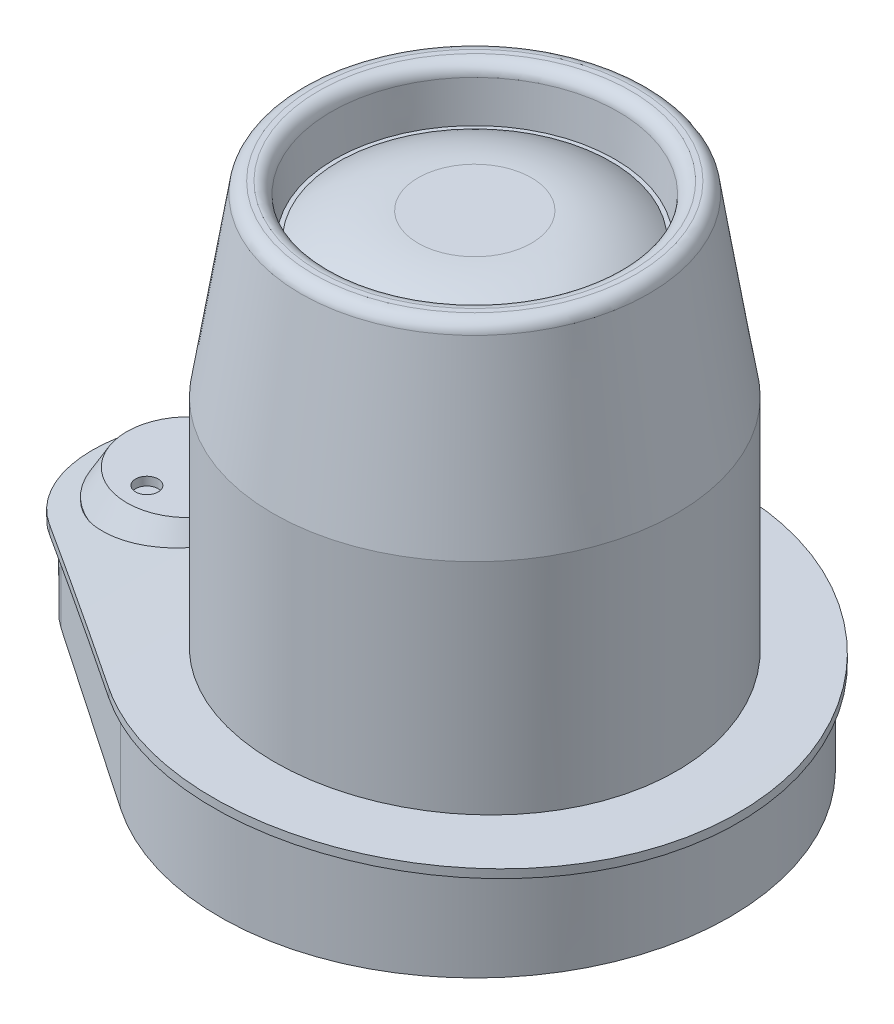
ISO-10303-21;
HEADER;
FILE_DESCRIPTION(('STEP AP214'),'2;1');
FILE_NAME('part.step','',(''),(''),'','','');
FILE_SCHEMA(('AUTOMOTIVE_DESIGN { 1 0 10303 214 1 1 1 1 }'));
ENDSEC;
DATA;
#1=APPLICATION_CONTEXT('core data for automotive mechanical design processes');
#2=APPLICATION_PROTOCOL_DEFINITION('international standard','automotive_design',2000,#1);
#3=PRODUCT_CONTEXT('',#1,'mechanical');
#4=PRODUCT('Part','Part','',(#3));
#5=PRODUCT_RELATED_PRODUCT_CATEGORY('part','',(#4));
#6=PRODUCT_DEFINITION_FORMATION('','',#4);
#7=PRODUCT_DEFINITION_CONTEXT('part definition',#1,'design');
#8=PRODUCT_DEFINITION('design','',#6,#7);
#9=PRODUCT_DEFINITION_SHAPE('','',#8);
#10=(LENGTH_UNIT() NAMED_UNIT(*) SI_UNIT(.MILLI.,.METRE.));
#11=(NAMED_UNIT(*) PLANE_ANGLE_UNIT() SI_UNIT($,.RADIAN.));
#12=(NAMED_UNIT(*) SI_UNIT($,.STERADIAN.) SOLID_ANGLE_UNIT());
#13=UNCERTAINTY_MEASURE_WITH_UNIT(LENGTH_MEASURE(1.E-05),#10,'distance_accuracy_value','');
#14=(GEOMETRIC_REPRESENTATION_CONTEXT(3) GLOBAL_UNCERTAINTY_ASSIGNED_CONTEXT((#13)) GLOBAL_UNIT_ASSIGNED_CONTEXT((#10,
#11,#12)) REPRESENTATION_CONTEXT('',''));
#15=CARTESIAN_POINT('',(0.,0.,0.));
#16=DIRECTION('',(0.,0.,1.));
#17=DIRECTION('',(1.,0.,0.));
#18=AXIS2_PLACEMENT_3D('',#15,#16,#17);
#19=CARTESIAN_POINT('',(0.,44.,0.));
#20=DIRECTION('',(0.,1.,0.));
#21=DIRECTION('',(0.,0.,1.));
#22=AXIS2_PLACEMENT_3D('',#19,#20,#21);
#23=PLANE('',#22);
#24=CARTESIAN_POINT('',(0.,44.,0.));
#25=DIRECTION('',(0.,1.,0.));
#26=DIRECTION('',(0.,0.,1.));
#27=AXIS2_PLACEMENT_3D('',#24,#25,#26);
#28=CIRCLE('',#27,16.4750680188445);
#29=CARTESIAN_POINT('',(0.,44.,16.4750680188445));
#30=VERTEX_POINT('',#29);
#31=EDGE_CURVE('E134',#30,#30,#28,.T.);
#32=ORIENTED_EDGE('',*,*,#31,.T.);
#33=EDGE_LOOP('',(#32));
#34=FACE_BOUND('',#33,.T.);
#35=CARTESIAN_POINT('',(0.,44.,0.));
#36=DIRECTION('',(0.,1.,0.));
#37=DIRECTION('',(0.,0.,1.));
#38=AXIS2_PLACEMENT_3D('',#35,#36,#37);
#39=CIRCLE('',#38,16.);
#40=CARTESIAN_POINT('',(0.,44.,16.));
#41=VERTEX_POINT('',#40);
#42=EDGE_CURVE('E198',#41,#41,#39,.T.);
#43=ORIENTED_EDGE('',*,*,#42,.F.);
#44=EDGE_LOOP('',(#43));
#45=FACE_BOUND('',#44,.T.);
#46=ADVANCED_FACE('F27',(#34,#45),#23,.T.);
#47=CARTESIAN_POINT('',(-2.46999999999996,-335.231240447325,-45.));
#48=DIRECTION('',(0.,0.,1.));
#49=DIRECTION('',(1.,0.,0.));
#50=AXIS2_PLACEMENT_3D('',#47,#48,#49);
#51=CYLINDRICAL_SURFACE('',#50,338.);
#52=CARTESIAN_POINT('',(-33.6737777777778,1.32532872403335,-9.));
#53=CARTESIAN_POINT('',(-33.9277894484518,1.30177821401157,-9.00000174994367));
#54=CARTESIAN_POINT('',(-34.1817450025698,1.2779419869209,-8.98924202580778));
#55=CARTESIAN_POINT('',(-34.6878824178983,1.22986081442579,-8.94628967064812));
#56=CARTESIAN_POINT('',(-34.9400637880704,1.20561576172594,-8.91409132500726));
#57=CARTESIAN_POINT('',(-35.4410492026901,1.15688855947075,-8.82844314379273));
#58=CARTESIAN_POINT('',(-35.6898492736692,1.13240618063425,-8.77497022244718));
#59=CARTESIAN_POINT('',(-36.1820335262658,1.08343356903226,-8.64715545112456));
#60=CARTESIAN_POINT('',(-36.4254176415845,1.05894333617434,-8.57281334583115));
#61=CARTESIAN_POINT('',(-36.9049223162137,1.01018201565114,-8.40382621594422));
#62=CARTESIAN_POINT('',(-37.1410463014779,0.985910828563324,-8.30919094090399));
#63=CARTESIAN_POINT('',(-37.604479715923,0.937798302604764,-8.10025856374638));
#64=CARTESIAN_POINT('',(-37.8317890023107,0.913956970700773,-7.98596114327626));
#65=CARTESIAN_POINT('',(-38.2758731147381,0.866943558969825,-7.73855897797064));
#66=CARTESIAN_POINT('',(-38.4926524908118,0.843771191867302,-7.60546245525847));
#67=CARTESIAN_POINT('',(-38.9143085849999,0.798307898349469,-7.32130412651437));
#68=CARTESIAN_POINT('',(-39.1191811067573,0.776017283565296,-7.17023604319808));
#69=CARTESIAN_POINT('',(-39.5152502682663,0.732580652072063,-6.85140559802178));
#70=CARTESIAN_POINT('',(-39.7064617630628,0.711433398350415,-6.68366185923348));
#71=CARTESIAN_POINT('',(-40.0741626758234,0.670473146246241,-6.33243579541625));
#72=CARTESIAN_POINT('',(-40.2506453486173,0.650660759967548,-6.14894633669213));
#73=CARTESIAN_POINT('',(-40.5875128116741,0.612598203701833,-5.76758173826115));
#74=CARTESIAN_POINT('',(-40.7478971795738,0.594348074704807,-5.56970622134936));
#75=CARTESIAN_POINT('',(-41.0513180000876,0.559624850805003,-5.1610688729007));
#76=CARTESIAN_POINT('',(-41.1943624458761,0.543150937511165,-4.95031304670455));
#77=CARTESIAN_POINT('',(-41.4615345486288,0.512230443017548,-4.51830267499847));
#78=CARTESIAN_POINT('',(-41.5857440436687,0.497775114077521,-4.29709936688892));
#79=CARTESIAN_POINT('',(-41.8150539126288,0.470978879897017,-3.84497705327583));
#80=CARTESIAN_POINT('',(-41.9201611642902,0.458637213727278,-3.61406158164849));
#81=CARTESIAN_POINT('',(-42.1105559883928,0.436207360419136,-3.14405347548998));
#82=CARTESIAN_POINT('',(-42.1958406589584,0.426119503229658,-2.9049596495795));
#83=CARTESIAN_POINT('',(-42.3459335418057,0.408321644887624,-2.42034270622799));
#84=CARTESIAN_POINT('',(-42.4107418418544,0.400611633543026,-2.17481961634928));
#85=CARTESIAN_POINT('',(-42.5190505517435,0.387704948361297,-1.68068947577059));
#86=CARTESIAN_POINT('',(-42.5626836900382,0.382492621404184,-1.43211191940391));
#87=CARTESIAN_POINT('',(-42.6289283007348,0.374572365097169,-0.932132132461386));
#88=CARTESIAN_POINT('',(-42.6515398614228,0.371864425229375,-0.680729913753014));
#89=CARTESIAN_POINT('',(-42.6755724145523,0.368986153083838,-0.176906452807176));
#90=CARTESIAN_POINT('',(-42.6769939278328,0.368815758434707,0.0755147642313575));
#91=CARTESIAN_POINT('',(-42.6586370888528,0.371014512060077,0.579573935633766));
#92=CARTESIAN_POINT('',(-42.6388587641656,0.373383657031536,0.831211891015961));
#93=CARTESIAN_POINT('',(-42.5783640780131,0.380618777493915,1.33096108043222));
#94=CARTESIAN_POINT('',(-42.5377266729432,0.385475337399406,1.57908201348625));
#95=CARTESIAN_POINT('',(-42.4358406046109,0.397623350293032,2.07108384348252));
#96=CARTESIAN_POINT('',(-42.3745848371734,0.404915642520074,2.31496324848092));
#97=CARTESIAN_POINT('',(-42.2319296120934,0.421845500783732,2.7966253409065));
#98=CARTESIAN_POINT('',(-42.1505337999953,0.43148264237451,3.03440912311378));
#99=CARTESIAN_POINT('',(-41.968187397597,0.45298857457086,3.50225692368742));
#100=CARTESIAN_POINT('',(-41.8672364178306,0.464857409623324,3.73232078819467));
#101=CARTESIAN_POINT('',(-41.6463220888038,0.490710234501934,4.18350821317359));
#102=CARTESIAN_POINT('',(-41.5263257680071,0.504697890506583,4.40461541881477));
#103=CARTESIAN_POINT('',(-41.26831555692,0.534611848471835,4.83592251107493));
#104=CARTESIAN_POINT('',(-41.13030126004,0.550538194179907,5.04612215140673));
#105=CARTESIAN_POINT('',(-40.8372741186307,0.584146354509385,5.45411691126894));
#106=CARTESIAN_POINT('',(-40.6822640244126,0.601827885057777,5.65191402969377));
#107=CARTESIAN_POINT('',(-40.3562773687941,0.638759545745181,6.03384254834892));
#108=CARTESIAN_POINT('',(-40.1852952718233,0.658010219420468,6.21796917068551));
#109=CARTESIAN_POINT('',(-39.8276186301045,0.697979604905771,6.5722106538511));
#110=CARTESIAN_POINT('',(-39.6408411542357,0.718705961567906,6.74224092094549));
#111=CARTESIAN_POINT('',(-39.2537363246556,0.761311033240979,7.06595536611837));
#112=CARTESIAN_POINT('',(-39.0534086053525,0.783189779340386,7.21963910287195));
#113=CARTESIAN_POINT('',(-38.64062391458,0.827874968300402,7.50959761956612));
#114=CARTESIAN_POINT('',(-38.4281668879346,0.850681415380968,7.6458723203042));
#115=CARTESIAN_POINT('',(-37.9926151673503,0.896996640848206,7.90007766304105));
#116=CARTESIAN_POINT('',(-37.7695202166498,0.920505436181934,8.01800786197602));
#117=CARTESIAN_POINT('',(-37.3129315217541,0.968139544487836,8.23534204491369));
#118=CARTESIAN_POINT('',(-37.0793847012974,0.992267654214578,8.3346339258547));
#119=CARTESIAN_POINT('',(-36.6047667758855,1.04078425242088,8.51314195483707));
#120=CARTESIAN_POINT('',(-36.3636956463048,1.06517274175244,8.59235803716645));
#121=CARTESIAN_POINT('',(-35.8757251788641,1.113995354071,8.73016066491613));
#122=CARTESIAN_POINT('',(-35.6288256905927,1.13842947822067,8.78874667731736));
#123=CARTESIAN_POINT('',(-35.1309526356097,1.18713706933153,8.884870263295));
#124=CARTESIAN_POINT('',(-34.8799791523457,1.21141053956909,8.92240826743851));
#125=CARTESIAN_POINT('',(-34.3750875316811,1.25966561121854,8.97623418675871));
#126=CARTESIAN_POINT('',(-34.1211635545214,1.28364631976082,8.99246814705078));
#127=CARTESIAN_POINT('',(-33.612808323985,1.33107273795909,9.0033836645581));
#128=CARTESIAN_POINT('',(-33.3583770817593,1.35451845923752,8.99806569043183));
#129=CARTESIAN_POINT('',(-32.8507679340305,1.40071570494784,8.96589883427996));
#130=CARTESIAN_POINT('',(-32.5975902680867,1.42346710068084,8.93904598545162));
#131=CARTESIAN_POINT('',(-32.094433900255,1.46811608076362,8.8639917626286));
#132=CARTESIAN_POINT('',(-31.8444541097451,1.49001396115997,8.8157978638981));
#133=CARTESIAN_POINT('',(-31.3496841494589,1.53280964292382,8.69845704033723));
#134=CARTESIAN_POINT('',(-31.104888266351,1.55370858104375,8.62933462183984));
#135=CARTESIAN_POINT('',(-30.6219479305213,1.59442151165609,8.47059268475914));
#136=CARTESIAN_POINT('',(-30.3838033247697,1.61423552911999,8.3809736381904));
#137=CARTESIAN_POINT('',(-29.9158729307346,1.65268492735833,8.18185816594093));
#138=CARTESIAN_POINT('',(-29.6860872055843,1.67132029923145,8.072361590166));
#139=CARTESIAN_POINT('',(-29.2365408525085,1.70733428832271,7.83425956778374));
#140=CARTESIAN_POINT('',(-29.0167800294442,1.72471293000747,7.70565449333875));
#141=CARTESIAN_POINT('',(-28.5895528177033,1.75809875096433,7.43067864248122));
#142=CARTESIAN_POINT('',(-28.38204954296,1.77411011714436,7.28436568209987));
#143=CARTESIAN_POINT('',(-27.9801525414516,1.80477057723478,6.97473699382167));
#144=CARTESIAN_POINT('',(-27.7857541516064,1.81942015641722,6.81142736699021));
#145=CARTESIAN_POINT('',(-27.4113611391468,1.84733163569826,6.46888894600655));
#146=CARTESIAN_POINT('',(-27.2313689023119,1.86059330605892,6.28965752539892));
#147=CARTESIAN_POINT('',(-26.8871291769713,1.88570305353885,5.91657196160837));
#148=CARTESIAN_POINT('',(-26.7228816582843,1.89755113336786,5.72271784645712));
#149=CARTESIAN_POINT('',(-26.4118596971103,1.91978148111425,5.32245817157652));
#150=CARTESIAN_POINT('',(-26.2650271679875,1.93016864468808,5.11609801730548));
#151=CARTESIAN_POINT('',(-25.9891950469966,1.94952204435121,4.69161775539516));
#152=CARTESIAN_POINT('',(-25.8602017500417,1.95848777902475,4.47349353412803));
#153=CARTESIAN_POINT('',(-25.6210664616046,1.97499094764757,4.0271491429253));
#154=CARTESIAN_POINT('',(-25.5109207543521,1.98252866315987,3.79893097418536));
#155=CARTESIAN_POINT('',(-25.3102447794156,1.99618035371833,3.33398097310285));
#156=CARTESIAN_POINT('',(-25.2197148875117,2.00229430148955,3.0972489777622));
#157=CARTESIAN_POINT('',(-25.0591016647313,2.01309079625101,2.61748191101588));
#158=CARTESIAN_POINT('',(-24.9889748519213,2.01777638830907,2.37446146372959));
#159=CARTESIAN_POINT('',(-24.8694125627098,2.02573859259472,1.88335461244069));
#160=CARTESIAN_POINT('',(-24.8199775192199,2.02901517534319,1.63526810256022));
#161=CARTESIAN_POINT('',(-24.7421582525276,2.03416318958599,1.13580445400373));
#162=CARTESIAN_POINT('',(-24.7137737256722,2.0360346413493,0.884427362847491));
#163=CARTESIAN_POINT('',(-24.678259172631,2.03837505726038,0.380169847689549));
#164=CARTESIAN_POINT('',(-24.6711291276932,2.03884402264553,0.127289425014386));
#165=CARTESIAN_POINT('',(-24.6781715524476,2.03838037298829,-0.37793159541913));
#166=CARTESIAN_POINT('',(-24.6923236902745,2.03744909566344,-0.630272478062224));
#167=CARTESIAN_POINT('',(-24.7417911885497,2.03418607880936,-1.13286198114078));
#168=CARTESIAN_POINT('',(-24.7771065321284,2.03185434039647,-1.38311060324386));
#169=CARTESIAN_POINT('',(-24.8686460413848,2.02578728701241,-1.87973649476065));
#170=CARTESIAN_POINT('',(-24.9248701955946,2.02205197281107,-2.12611376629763));
#171=CARTESIAN_POINT('',(-25.0578224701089,2.01317345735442,-2.6132466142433));
#172=CARTESIAN_POINT('',(-25.1345506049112,2.00803025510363,-2.85400218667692));
#173=CARTESIAN_POINT('',(-25.3079610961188,1.99633119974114,-3.32818935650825));
#174=CARTESIAN_POINT('',(-25.40464406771,1.98977530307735,-3.56162072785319));
#175=CARTESIAN_POINT('',(-25.6172646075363,1.97524746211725,-4.01949092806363));
#176=CARTESIAN_POINT('',(-25.7332017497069,1.9672755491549,-4.24392995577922));
#177=CARTESIAN_POINT('',(-25.9834960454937,1.94991447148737,-4.68222742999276));
#178=CARTESIAN_POINT('',(-26.1178528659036,1.94052533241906,-4.89608606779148));
#179=CARTESIAN_POINT('',(-26.404019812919,1.9203326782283,-5.31171130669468));
#180=CARTESIAN_POINT('',(-26.5558296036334,1.90952919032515,-5.51347814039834));
#181=CARTESIAN_POINT('',(-26.8759805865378,1.88650439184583,-5.9037032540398));
#182=CARTESIAN_POINT('',(-27.0443387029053,1.87428162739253,-6.09214756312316));
#183=CARTESIAN_POINT('',(-27.3961849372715,1.84844805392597,-6.45410793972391));
#184=CARTESIAN_POINT('',(-27.579667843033,1.83483772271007,-6.62762910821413));
#185=CARTESIAN_POINT('',(-27.960581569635,1.80624520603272,-6.9586699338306));
#186=CARTESIAN_POINT('',(-28.1580183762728,1.79126243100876,-7.11618265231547));
#187=CARTESIAN_POINT('',(-28.5653536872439,1.75996749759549,-7.41401779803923));
#188=CARTESIAN_POINT('',(-28.7752520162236,1.74365535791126,-7.55434046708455));
#189=CARTESIAN_POINT('',(-29.2065783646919,1.70970732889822,-7.81716539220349));
#190=CARTESIAN_POINT('',(-29.4280350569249,1.69206809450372,-7.93962016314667));
#191=CARTESIAN_POINT('',(-29.8803848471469,1.65556886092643,-8.16541935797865));
#192=CARTESIAN_POINT('',(-30.1112778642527,1.63670887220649,-8.26876394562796));
#193=CARTESIAN_POINT('',(-30.580615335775,1.59786856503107,-8.45553450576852));
#194=CARTESIAN_POINT('',(-30.8190516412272,1.57788943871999,-8.53898119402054));
#195=CARTESIAN_POINT('',(-31.3019313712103,1.53689708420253,-8.68550542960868));
#196=CARTESIAN_POINT('',(-31.5463732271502,1.5158841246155,-8.74858823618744));
#197=CARTESIAN_POINT('',(-32.1019169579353,1.46750550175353,-8.86729864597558));
#198=CARTESIAN_POINT('',(-32.4142736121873,1.43987490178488,-8.91702730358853));
#199=CARTESIAN_POINT('',(-33.0423749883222,1.38341951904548,-8.98337690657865));
#200=CARTESIAN_POINT('',(-33.3581197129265,1.35459473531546,-8.99999782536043));
#201=CARTESIAN_POINT('',(-33.6737777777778,1.32532872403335,-9.));
#202=B_SPLINE_CURVE_WITH_KNOTS('',3,(#52,#53,#54,#55,#56,#57,#58,#59,#60,#61,#62,#63,#64,#65,
#66,#67,#68,#69,#70,#71,#72,#73,#74,#75,#76,#77,#78,#79,#80,#81,#82,#83,#84,#85,#86,#87,#88,#89,
#90,#91,#92,#93,#94,#95,#96,#97,#98,#99,#100,#101,#102,#103,#104,#105,#106,#107,#108,#109,#110,
#111,#112,#113,#114,#115,#116,#117,#118,#119,#120,#121,#122,#123,#124,#125,#126,#127,#128,#129,
#130,#131,#132,#133,#134,#135,#136,#137,#138,#139,#140,#141,#142,#143,#144,#145,#146,#147,#148,
#149,#150,#151,#152,#153,#154,#155,#156,#157,#158,#159,#160,#161,#162,#163,#164,#165,#166,#167,
#168,#169,#170,#171,#172,#173,#174,#175,#176,#177,#178,#179,#180,#181,#182,#183,#184,#185,#186,
#187,#188,#189,#190,#191,#192,#193,#194,#195,#196,#197,#198,#199,#200,#201),.UNSPECIFIED.,.T.,
.F.,(4,2,2,2,2,2,2,2,2,2,2,2,2,2,2,2,2,2,2,2,2,2,2,2,2,2,2,2,2,2,2,2,2,2,2,2,2,2,2,2,2,2,2,2,2,
2,2,2,2,2,2,2,2,2,2,2,2,2,2,2,2,2,2,2,2,2,2,2,2,2,2,2,2,2,4),(0.,0.765025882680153,
1.53025577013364,2.29631830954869,3.06239022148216,3.82809490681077,4.59381199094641,
5.35919520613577,6.12484655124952,6.88965223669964,7.65480627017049,8.41998037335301,
9.18480040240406,9.94619569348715,10.7073162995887,11.4685482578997,12.2297769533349,
12.9861704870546,13.7425608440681,14.498932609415,15.255303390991,16.0088320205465,
16.7626205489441,17.516272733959,18.2699399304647,19.024926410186,19.7799299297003,
20.5348114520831,21.2899555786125,22.0493451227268,22.8087551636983,23.5681686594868,
24.3276004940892,25.0914631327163,25.8553282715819,26.6192131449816,27.3830823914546,
28.1488825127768,28.9146659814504,29.6805905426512,30.446247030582,31.2110104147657,
31.9757561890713,32.740507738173,33.5052443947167,34.2675483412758,35.0295795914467,
35.7917367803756,36.5538925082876,37.3134300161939,38.0732348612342,38.8328897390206,
39.5925591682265,40.3505975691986,41.1086518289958,41.8666951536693,42.6247378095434,
43.3820567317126,44.1393750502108,44.8966929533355,45.654011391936,46.411353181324,
47.1686782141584,47.9259895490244,48.683286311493,49.4413657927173,50.1991851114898,
50.9573315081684,51.7154672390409,52.4755824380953,53.2356911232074,53.9950049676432,
54.7541225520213,55.7048127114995,56.6555036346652),.UNSPECIFIED.);
#203=CARTESIAN_POINT('',(-37.0033599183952,0.999999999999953,-8.36145219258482));
#204=VERTEX_POINT('',#203);
#205=CARTESIAN_POINT('',(-37.0033599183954,0.99999999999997,8.36145219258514));
#206=VERTEX_POINT('',#205);
#207=EDGE_CURVE('E192',#204,#206,#202,.T.);
#208=ORIENTED_EDGE('',*,*,#207,.F.);
#209=CARTESIAN_POINT('',(-37.0033599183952,0.999999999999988,-8.36145219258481));
#210=CARTESIAN_POINT('',(-36.7627849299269,1.02471146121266,-8.44192175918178));
#211=CARTESIAN_POINT('',(-36.5187953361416,1.04950745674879,-8.51213621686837));
#212=CARTESIAN_POINT('',(-36.0257610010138,1.09906118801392,-8.63168480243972));
#213=CARTESIAN_POINT('',(-35.7767165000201,1.12381892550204,-8.68101992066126));
#214=CARTESIAN_POINT('',(-35.2754451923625,1.17307921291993,-8.75842858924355));
#215=CARTESIAN_POINT('',(-35.0232199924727,1.1975818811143,-8.78651246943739));
#216=CARTESIAN_POINT('',(-34.5172596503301,1.24615508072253,-8.82126474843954));
#217=CARTESIAN_POINT('',(-34.2635245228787,1.27022561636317,-8.82793335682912));
#218=CARTESIAN_POINT('',(-33.7561045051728,1.3177822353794,-8.81978759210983));
#219=CARTESIAN_POINT('',(-33.502419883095,1.34126775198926,-8.80495315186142));
#220=CARTESIAN_POINT('',(-32.997145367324,1.3874722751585,-8.75384396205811));
#221=CARTESIAN_POINT('',(-32.7455554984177,1.41019127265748,-8.71756895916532));
#222=CARTESIAN_POINT('',(-32.2463371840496,1.45471490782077,-8.62381129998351));
#223=CARTESIAN_POINT('',(-31.9987078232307,1.47651975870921,-8.56633362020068));
#224=CARTESIAN_POINT('',(-31.5091405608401,1.51909539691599,-8.43053647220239));
#225=CARTESIAN_POINT('',(-31.2672026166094,1.53986619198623,-8.35221716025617));
#226=CARTESIAN_POINT('',(-30.7915957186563,1.58019639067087,-8.17555232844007));
#227=CARTESIAN_POINT('',(-30.5579012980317,1.59975969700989,-8.07727626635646));
#228=CARTESIAN_POINT('',(-30.0995421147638,1.63766774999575,-7.86114780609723));
#229=CARTESIAN_POINT('',(-29.8748805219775,1.65601207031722,-7.74328860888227));
#230=CARTESIAN_POINT('',(-29.4363467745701,1.69139835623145,-7.488822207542));
#231=CARTESIAN_POINT('',(-29.222473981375,1.70844039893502,-7.35221611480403));
#232=CARTESIAN_POINT('',(-28.8070994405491,1.74116287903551,-7.06118808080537));
#233=CARTESIAN_POINT('',(-28.605597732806,1.75684331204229,-6.90676608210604));
#234=CARTESIAN_POINT('',(-28.2183977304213,1.78664833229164,-6.58278320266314));
#235=CARTESIAN_POINT('',(-28.0325638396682,1.80078666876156,-6.41338562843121));
#236=CARTESIAN_POINT('',(-27.6759050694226,1.82764808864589,-6.05935322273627));
#237=CARTESIAN_POINT('',(-27.5050804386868,1.84037114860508,-5.87471813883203));
#238=CARTESIAN_POINT('',(-27.1797834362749,1.86437388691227,-5.49156963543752));
#239=CARTESIAN_POINT('',(-27.0253062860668,1.87565398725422,-5.29306029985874));
#240=CARTESIAN_POINT('',(-26.7337744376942,1.89676287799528,-4.88345741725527));
#241=CARTESIAN_POINT('',(-26.5967257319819,1.90659116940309,-4.67235957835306));
#242=CARTESIAN_POINT('',(-26.3426568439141,1.92467644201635,-4.24168688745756));
#243=CARTESIAN_POINT('',(-26.2254221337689,1.93295037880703,-4.02223928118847));
#244=CARTESIAN_POINT('',(-26.0099509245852,1.94806256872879,-3.57415614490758));
#245=CARTESIAN_POINT('',(-25.9117145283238,1.95490081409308,-3.34552056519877));
#246=CARTESIAN_POINT('',(-25.7349947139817,1.96714014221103,-2.88071166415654));
#247=CARTESIAN_POINT('',(-25.65651049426,1.97254128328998,-2.64453864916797));
#248=CARTESIAN_POINT('',(-25.5198907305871,1.98190762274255,-2.16634485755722));
#249=CARTESIAN_POINT('',(-25.4617555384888,1.98587279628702,-1.92432397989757));
#250=CARTESIAN_POINT('',(-25.3667226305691,1.99233871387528,-1.43843881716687));
#251=CARTESIAN_POINT('',(-25.3296347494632,1.99485257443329,-1.19461188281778));
#252=CARTESIAN_POINT('',(-25.2761496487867,1.99847393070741,-0.704607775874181));
#253=CARTESIAN_POINT('',(-25.2597591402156,1.99958097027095,-0.45842986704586));
#254=CARTESIAN_POINT('',(-25.2478169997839,2.00038779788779,0.0343841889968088));
#255=CARTESIAN_POINT('',(-25.2522612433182,2.00008786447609,0.281020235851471));
#256=CARTESIAN_POINT('',(-25.2819453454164,1.99808118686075,0.773031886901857));
#257=CARTESIAN_POINT('',(-25.3071851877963,1.99637444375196,1.01840749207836));
#258=CARTESIAN_POINT('',(-25.3781393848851,1.991561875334,1.50525570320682));
#259=CARTESIAN_POINT('',(-25.4237791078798,1.98846114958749,1.74673924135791));
#260=CARTESIAN_POINT('',(-25.5351510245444,1.98086182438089,2.22492183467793));
#261=CARTESIAN_POINT('',(-25.6008766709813,1.97636368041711,2.46162242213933));
#262=CARTESIAN_POINT('',(-25.7519457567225,1.9659670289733,2.92869074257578));
#263=CARTESIAN_POINT('',(-25.837292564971,1.96006828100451,3.15905738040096));
#264=CARTESIAN_POINT('',(-26.0269588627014,1.94687082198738,3.6117953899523));
#265=CARTESIAN_POINT('',(-26.1312780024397,1.93957213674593,3.83416690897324));
#266=CARTESIAN_POINT('',(-26.3583932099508,1.92355731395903,4.2699023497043));
#267=CARTESIAN_POINT('',(-26.4812337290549,1.91483776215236,4.48324297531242));
#268=CARTESIAN_POINT('',(-26.744293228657,1.8959997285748,4.89885710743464));
#269=CARTESIAN_POINT('',(-26.8845120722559,1.88588125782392,5.10113070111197));
#270=CARTESIAN_POINT('',(-27.1813296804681,1.86425392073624,5.49326370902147));
#271=CARTESIAN_POINT('',(-27.3379317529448,1.85274477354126,5.68312060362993));
#272=CARTESIAN_POINT('',(-27.6662970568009,1.82835918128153,6.04902464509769));
#273=CARTESIAN_POINT('',(-27.8380552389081,1.8154831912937,6.22507635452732));
#274=CARTESIAN_POINT('',(-28.1969963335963,1.78827576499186,6.56363355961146));
#275=CARTESIAN_POINT('',(-28.3842934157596,1.77393333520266,6.72601713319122));
#276=CARTESIAN_POINT('',(-28.7717226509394,1.74391757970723,7.03452577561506));
#277=CARTESIAN_POINT('',(-28.9718545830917,1.72824427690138,7.18065112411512));
#278=CARTESIAN_POINT('',(-29.3835169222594,1.69561397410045,7.45567624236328));
#279=CARTESIAN_POINT('',(-29.5950470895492,1.67865700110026,7.58457637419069));
#280=CARTESIAN_POINT('',(-30.0280064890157,1.64351883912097,7.82431316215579));
#281=CARTESIAN_POINT('',(-30.2494356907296,1.62533765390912,7.93514987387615));
#282=CARTESIAN_POINT('',(-30.7031475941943,1.58761555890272,8.13917737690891));
#283=CARTESIAN_POINT('',(-30.9355235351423,1.56806178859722,8.23215848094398));
#284=CARTESIAN_POINT('',(-31.4070765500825,1.52787460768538,8.39830060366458));
#285=CARTESIAN_POINT('',(-31.6462513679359,1.50724155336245,8.47146811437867));
#286=CARTESIAN_POINT('',(-32.1299510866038,1.46498209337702,8.59760394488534));
#287=CARTESIAN_POINT('',(-32.3744793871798,1.44335504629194,8.65055901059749));
#288=CARTESIAN_POINT('',(-32.8670171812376,1.39924313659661,8.73587531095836));
#289=CARTESIAN_POINT('',(-33.1150265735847,1.37675829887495,8.76823714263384));
#290=CARTESIAN_POINT('',(-33.6156507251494,1.33080782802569,8.81243027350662));
#291=CARTESIAN_POINT('',(-33.8682857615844,1.30733393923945,8.82402346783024));
#292=CARTESIAN_POINT('',(-34.3735771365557,1.25980869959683,8.82589417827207));
#293=CARTESIAN_POINT('',(-34.6262334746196,1.23575735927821,8.81617208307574));
#294=CARTESIAN_POINT('',(-35.129385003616,1.18729109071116,8.77553030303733));
#295=CARTESIAN_POINT('',(-35.3798829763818,1.162876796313,8.74464410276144));
#296=CARTESIAN_POINT('',(-35.8772701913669,1.11384526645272,8.66193544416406));
#297=CARTESIAN_POINT('',(-36.1241613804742,1.08922815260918,8.61012474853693));
#298=CARTESIAN_POINT('',(-36.4753804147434,1.05382567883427,8.52084390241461));
#299=CARTESIAN_POINT('',(-36.581874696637,1.04303948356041,8.49167034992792));
#300=CARTESIAN_POINT('',(-36.7935751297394,1.02149707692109,8.42945584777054));
#301=CARTESIAN_POINT('',(-36.8987828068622,1.01074084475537,8.39642009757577));
#302=CARTESIAN_POINT('',(-37.0033599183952,0.999999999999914,8.36145219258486));
#303=B_SPLINE_CURVE_WITH_KNOTS('',3,(#209,#210,#211,#212,#213,#214,#215,#216,#217,#218,#219,
#220,#221,#222,#223,#224,#225,#226,#227,#228,#229,#230,#231,#232,#233,#234,#235,#236,#237,#238,
#239,#240,#241,#242,#243,#244,#245,#246,#247,#248,#249,#250,#251,#252,#253,#254,#255,#256,#257,
#258,#259,#260,#261,#262,#263,#264,#265,#266,#267,#268,#269,#270,#271,#272,#273,#274,#275,#276,
#277,#278,#279,#280,#281,#282,#283,#284,#285,#286,#287,#288,#289,#290,#291,#292,#293,#294,#295,
#296,#297,#298,#299,#300,#301,#302),.UNSPECIFIED.,.F.,.F.,(4,2,2,2,2,2,2,2,2,2,2,2,2,2,2,2,2,2,
2,2,2,2,2,2,2,2,2,2,2,2,2,2,2,2,2,2,2,2,2,2,2,2,2,2,2,2,4),(0.,0.764395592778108,
1.52875492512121,2.29274247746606,3.05672255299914,3.82141605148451,4.58611858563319,
5.35064174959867,6.11515918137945,6.87706002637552,7.63922594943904,8.40134670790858,
9.16346992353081,9.91811951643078,10.6727816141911,11.4272225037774,12.1819220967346,
12.9278385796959,13.6737590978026,14.4196493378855,15.1655524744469,15.9046043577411,
16.643895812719,17.3830409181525,18.122185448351,18.8586477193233,19.5948701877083,
20.3312191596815,21.0675545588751,21.8056861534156,22.543811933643,23.2820870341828,
24.020117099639,24.7641543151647,25.5081787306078,26.2521875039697,26.9961939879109,
27.7484649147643,28.5004890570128,29.2530054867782,30.0055000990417,30.7665678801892,
31.5276217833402,32.2874743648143,33.0469003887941,33.379669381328,33.7119954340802),.UNSPECIFIED.);
#304=EDGE_CURVE('E11',#204,#206,#303,.T.);
#305=ORIENTED_EDGE('',*,*,#304,.T.);
#306=EDGE_LOOP('',(#208,#305));
#307=FACE_BOUND('',#306,.T.);
#308=CARTESIAN_POINT('',(-2.46999999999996,-335.231240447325,35.8136456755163));
#309=DIRECTION('',(0.562499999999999,0.,-0.826797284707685));
#310=DIRECTION('',(0.826797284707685,0.,0.562499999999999));
#311=AXIS2_PLACEMENT_3D('',#308,#309,#310);
#312=ELLIPSE('',#311,408.80637400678,338.);
#313=CARTESIAN_POINT('',(-17.4375,2.43719743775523,25.6307158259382));
#314=VERTEX_POINT('',#313);
#315=CARTESIAN_POINT('',(-39.3125,0.754816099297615,10.7483647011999));
#316=VERTEX_POINT('',#315);
#317=EDGE_CURVE('E258',#314,#316,#312,.F.);
#318=ORIENTED_EDGE('',*,*,#317,.F.);
#319=CARTESIAN_POINT('',(0.,2.75973443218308,-31.));
#320=CARTESIAN_POINT('',(0.869372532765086,2.75338317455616,-31.0000080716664));
#321=CARTESIAN_POINT('',(1.73859545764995,2.7436676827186,-30.963414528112));
#322=CARTESIAN_POINT('',(3.47107389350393,2.71765201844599,-30.8173215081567));
#323=CARTESIAN_POINT('',(4.33432788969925,2.70135023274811,-30.7078041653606));
#324=CARTESIAN_POINT('',(6.04931045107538,2.66246764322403,-30.4164958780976));
#325=CARTESIAN_POINT('',(6.90102618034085,2.63988036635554,-30.2346303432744));
#326=CARTESIAN_POINT('',(8.5859348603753,2.58894345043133,-29.7999766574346));
#327=CARTESIAN_POINT('',(9.41912894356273,2.56059416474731,-29.5471928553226));
#328=CARTESIAN_POINT('',(11.0606626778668,2.49882258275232,-28.9727023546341));
#329=CARTESIAN_POINT('',(11.8690165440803,2.465403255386,-28.6510359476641));
#330=CARTESIAN_POINT('',(13.4556967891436,2.39429609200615,-27.9410031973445));
#331=CARTESIAN_POINT('',(14.2340227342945,2.35660819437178,-27.5526358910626));
#332=CARTESIAN_POINT('',(15.7550068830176,2.27791348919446,-26.712068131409));
#333=CARTESIAN_POINT('',(16.4976728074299,2.23690740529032,-26.2598815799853));
#334=CARTESIAN_POINT('',(17.9423223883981,2.15260730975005,-25.2948149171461));
#335=CARTESIAN_POINT('',(18.6443060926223,2.10931330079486,-24.7819348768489));
#336=CARTESIAN_POINT('',(20.0046929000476,2.02141594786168,-23.697492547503));
#337=CARTESIAN_POINT('',(20.6629615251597,1.97680912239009,-23.1257618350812));
#338=CARTESIAN_POINT('',(21.9290218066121,1.88756734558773,-21.928904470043));
#339=CARTESIAN_POINT('',(22.5368133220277,1.84293239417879,-21.3037776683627));
#340=CARTESIAN_POINT('',(23.6976633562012,1.75480133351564,-20.0044922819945));
#341=CARTESIAN_POINT('',(24.2507194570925,1.71130527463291,-19.3303315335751));
#342=CARTESIAN_POINT('',(25.2981562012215,1.62660150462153,-17.9377368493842));
#343=CARTESIAN_POINT('',(25.7925368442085,1.58539379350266,-17.2193029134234));
#344=CARTESIAN_POINT('',(26.7198045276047,1.50630165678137,-15.7420988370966));
#345=CARTESIAN_POINT('',(27.1525977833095,1.46842233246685,-14.9832695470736));
#346=CARTESIAN_POINT('',(27.9526943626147,1.39707249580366,-13.43163459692));
#347=CARTESIAN_POINT('',(28.3199975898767,1.36360198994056,-12.6388288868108));
#348=CARTESIAN_POINT('',(28.9864468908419,1.3019733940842,-11.0248863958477));
#349=CARTESIAN_POINT('',(29.2855943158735,1.27381519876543,-10.2037501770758));
#350=CARTESIAN_POINT('',(29.8135573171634,1.22357422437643,-8.53898911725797));
#351=CARTESIAN_POINT('',(30.0423731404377,1.20149142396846,-7.69536435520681));
#352=CARTESIAN_POINT('',(30.4273208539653,1.16406806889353,-5.9946362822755));
#353=CARTESIAN_POINT('',(30.5837031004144,1.14870430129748,-5.13759014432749));
#354=CARTESIAN_POINT('',(30.8238091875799,1.12502433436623,-3.4132831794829));
#355=CARTESIAN_POINT('',(30.9075331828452,1.11670812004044,-2.54602237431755));
#356=CARTESIAN_POINT('',(31.0017052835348,1.10734966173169,-0.807511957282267));
#357=CARTESIAN_POINT('',(31.0121550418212,1.10630725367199,0.0637375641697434));
#358=CARTESIAN_POINT('',(30.9597058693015,1.11152438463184,1.80400310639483));
#359=CARTESIAN_POINT('',(30.8968070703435,1.11778391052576,2.67301913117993));
#360=CARTESIAN_POINT('',(30.6984701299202,1.13740025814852,4.3995925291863));
#361=CARTESIAN_POINT('',(30.5632844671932,1.15073237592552,5.2571792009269));
#362=CARTESIAN_POINT('',(30.2215208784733,1.18411874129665,6.95787049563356));
#363=CARTESIAN_POINT('',(30.0149431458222,1.20417297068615,7.80097515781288));
#364=CARTESIAN_POINT('',(29.5318929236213,1.25046433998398,9.4667494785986));
#365=CARTESIAN_POINT('',(29.2554198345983,1.27670153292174,10.2894189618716));
#366=CARTESIAN_POINT('',(28.6345732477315,1.33465599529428,11.9085246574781));
#367=CARTESIAN_POINT('',(28.2901995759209,1.36637327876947,12.7049608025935));
#368=CARTESIAN_POINT('',(27.5353728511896,1.43450084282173,14.267348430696));
#369=CARTESIAN_POINT('',(27.1248080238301,1.47091904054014,15.0332455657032));
#370=CARTESIAN_POINT('',(26.2409457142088,1.54743801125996,16.5277482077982));
#371=CARTESIAN_POINT('',(25.7676481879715,1.58753878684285,17.2563536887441));
#372=CARTESIAN_POINT('',(24.7616571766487,1.67036457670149,18.6712025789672));
#373=CARTESIAN_POINT('',(24.2289622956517,1.71308965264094,19.3574449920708));
#374=CARTESIAN_POINT('',(23.1079305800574,1.800042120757,20.6827669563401));
#375=CARTESIAN_POINT('',(22.5195935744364,1.84426951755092,21.3218463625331));
#376=CARTESIAN_POINT('',(21.288727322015,1.93326710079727,22.5510499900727));
#377=CARTESIAN_POINT('',(20.6459739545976,1.97803880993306,23.1409496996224));
#378=CARTESIAN_POINT('',(19.3130174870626,2.06676755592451,24.2645246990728));
#379=CARTESIAN_POINT('',(18.6228142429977,2.1107245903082,24.7981998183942));
#380=CARTESIAN_POINT('',(17.1998090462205,2.19668754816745,25.8055516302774));
#381=CARTESIAN_POINT('',(16.4670068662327,2.23869346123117,26.2792280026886));
#382=CARTESIAN_POINT('',(14.9639667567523,2.3196788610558,27.163207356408));
#383=CARTESIAN_POINT('',(14.1937288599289,2.35865835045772,27.5735103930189));
#384=CARTESIAN_POINT('',(12.6207617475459,2.43262959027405,28.328037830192));
#385=CARTESIAN_POINT('',(11.8180125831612,2.46761884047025,28.672220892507));
#386=CARTESIAN_POINT('',(10.1861654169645,2.53271291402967,29.2917002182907));
#387=CARTESIAN_POINT('',(9.35706739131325,2.56281773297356,29.5669964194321));
#388=CARTESIAN_POINT('',(7.67844424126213,2.61741530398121,30.0466877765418));
#389=CARTESIAN_POINT('',(6.82891953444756,2.64190817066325,30.2510843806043));
#390=CARTESIAN_POINT('',(5.11550200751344,2.68471732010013,30.5874789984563));
#391=CARTESIAN_POINT('',(4.25160923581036,2.70303362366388,30.7194772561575));
#392=CARTESIAN_POINT('',(2.51888752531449,2.7330461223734,30.9097397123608));
#393=CARTESIAN_POINT('',(1.65008895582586,2.74476672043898,30.9682767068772));
#394=CARTESIAN_POINT('',(-0.0894171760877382,2.76149520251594,31.0120774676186));
#395=CARTESIAN_POINT('',(-0.960124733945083,2.76650310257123,30.9973414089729));
#396=CARTESIAN_POINT('',(-2.69721613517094,2.76979912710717,30.8946924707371));
#397=CARTESIAN_POINT('',(-3.56360003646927,2.76808734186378,30.8067805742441));
#398=CARTESIAN_POINT('',(-5.28586752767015,2.75812698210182,30.558412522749));
#399=CARTESIAN_POINT('',(-6.14175112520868,2.74987841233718,30.3979564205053));
#400=CARTESIAN_POINT('',(-7.83495204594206,2.72723710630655,30.006114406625));
#401=CARTESIAN_POINT('',(-8.67230773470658,2.71285862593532,29.7748934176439));
#402=CARTESIAN_POINT('',(-10.3245635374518,2.67849406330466,29.2430604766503));
#403=CARTESIAN_POINT('',(-11.1394636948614,2.65850799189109,28.9424486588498));
#404=CARTESIAN_POINT('',(-12.7410703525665,2.6136159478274,28.2739833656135));
#405=CARTESIAN_POINT('',(-13.5277765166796,2.58870991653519,27.9061290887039));
#406=CARTESIAN_POINT('',(-15.0674567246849,2.53479923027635,27.1058026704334));
#407=CARTESIAN_POINT('',(-15.8204306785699,2.50579456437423,26.6733303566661));
#408=CARTESIAN_POINT('',(-17.2890773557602,2.44454557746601,25.7457547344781));
#409=CARTESIAN_POINT('',(-18.0046592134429,2.41229387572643,25.2505080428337));
#410=CARTESIAN_POINT('',(-19.391607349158,2.34562684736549,24.2016834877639));
#411=CARTESIAN_POINT('',(-20.0629735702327,2.3112115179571,23.6481055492));
#412=CARTESIAN_POINT('',(-21.3567932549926,2.24129009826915,22.486511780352));
#413=CARTESIAN_POINT('',(-21.9792458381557,2.20578398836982,21.8784949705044));
#414=CARTESIAN_POINT('',(-23.1708578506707,2.13477864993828,20.6123056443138));
#415=CARTESIAN_POINT('',(-23.7400171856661,2.09927942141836,19.9541330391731));
#416=CARTESIAN_POINT('',(-24.8226881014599,2.02927104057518,18.5901747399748));
#417=CARTESIAN_POINT('',(-25.3360249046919,1.99476523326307,17.8842501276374));
#418=CARTESIAN_POINT('',(-26.3014092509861,1.92791803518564,16.4315682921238));
#419=CARTESIAN_POINT('',(-26.7534566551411,1.89557664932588,15.6848109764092));
#420=CARTESIAN_POINT('',(-27.5930339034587,1.83405060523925,14.1557480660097));
#421=CARTESIAN_POINT('',(-27.9805641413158,1.80486592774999,13.3734426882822));
#422=CARTESIAN_POINT('',(-28.6883290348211,1.75054731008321,11.7788245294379));
#423=CARTESIAN_POINT('',(-29.0085638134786,1.72541336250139,10.9665118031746));
#424=CARTESIAN_POINT('',(-29.5791495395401,1.67998808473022,9.31845417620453));
#425=CARTESIAN_POINT('',(-29.8295680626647,1.65969207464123,8.48273280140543));
#426=CARTESIAN_POINT('',(-30.2591194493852,1.62453185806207,6.79305304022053));
#427=CARTESIAN_POINT('',(-30.4382523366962,1.60966764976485,5.93909465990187));
#428=CARTESIAN_POINT('',(-30.7239256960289,1.5858260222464,4.21905370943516));
#429=CARTESIAN_POINT('',(-30.830467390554,1.5768485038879,3.35297134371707));
#430=CARTESIAN_POINT('',(-30.970184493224,1.56505469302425,1.61486789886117));
#431=CARTESIAN_POINT('',(-31.00336007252,1.56223838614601,0.742846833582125));
#432=CARTESIAN_POINT('',(-30.9961145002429,1.56285213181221,-0.998112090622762));
#433=CARTESIAN_POINT('',(-30.9559269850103,1.56626235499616,-1.86705093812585));
#434=CARTESIAN_POINT('',(-30.8027037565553,1.57918663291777,-3.5984343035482));
#435=CARTESIAN_POINT('',(-30.6896682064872,1.58870067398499,-4.46087883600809));
#436=CARTESIAN_POINT('',(-30.3915693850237,1.6135432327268,-6.17314271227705));
#437=CARTESIAN_POINT('',(-30.2065060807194,1.62887175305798,-7.02296205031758));
#438=CARTESIAN_POINT('',(-29.7656899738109,1.66487730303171,-8.70394802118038));
#439=CARTESIAN_POINT('',(-29.5099371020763,1.68555433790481,-9.53511463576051));
#440=CARTESIAN_POINT('',(-28.9296060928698,1.73162678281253,-11.1728498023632));
#441=CARTESIAN_POINT('',(-28.6050335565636,1.75702180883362,-11.9794203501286));
#442=CARTESIAN_POINT('',(-27.8893728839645,1.81176005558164,-13.5623501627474));
#443=CARTESIAN_POINT('',(-27.4982847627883,1.8411032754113,-14.3387094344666));
#444=CARTESIAN_POINT('',(-26.6523809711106,1.90284592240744,-15.8557503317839));
#445=CARTESIAN_POINT('',(-26.1975663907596,1.93524529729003,-16.5964325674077));
#446=CARTESIAN_POINT('',(-25.2274201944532,2.00211516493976,-18.0369437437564));
#447=CARTESIAN_POINT('',(-24.7120884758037,2.03658566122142,-18.7367726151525));
#448=CARTESIAN_POINT('',(-23.6228768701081,2.10665309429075,-20.0927410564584));
#449=CARTESIAN_POINT('',(-23.0488235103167,2.14225314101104,-20.7487411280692));
#450=CARTESIAN_POINT('',(-21.8475255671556,2.2133823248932,-22.0100923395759));
#451=CARTESIAN_POINT('',(-21.2202806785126,2.24891146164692,-22.6154431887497));
#452=CARTESIAN_POINT('',(-19.9168594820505,2.31880477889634,-23.7713620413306));
#453=CARTESIAN_POINT('',(-19.2406712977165,2.35316867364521,-24.3219166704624));
#454=CARTESIAN_POINT('',(-17.8442721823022,2.41964468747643,-25.3641675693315));
#455=CARTESIAN_POINT('',(-17.1240619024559,2.45175683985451,-25.8558647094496));
#456=CARTESIAN_POINT('',(-15.6434985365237,2.51275823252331,-26.7776510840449));
#457=CARTESIAN_POINT('',(-14.8830829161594,2.54164222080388,-27.2076402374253));
#458=CARTESIAN_POINT('',(-13.3285213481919,2.59519040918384,-28.0020091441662));
#459=CARTESIAN_POINT('',(-12.5343732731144,2.61985434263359,-28.3663847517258));
#460=CARTESIAN_POINT('',(-10.9188705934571,2.6641111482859,-29.0265185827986));
#461=CARTESIAN_POINT('',(-10.0975454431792,2.68370931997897,-29.3223484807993));
#462=CARTESIAN_POINT('',(-8.43304379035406,2.71718050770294,-29.8436659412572));
#463=CARTESIAN_POINT('',(-7.58987277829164,2.73105494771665,-30.069170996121));
#464=CARTESIAN_POINT('',(-5.63367249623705,2.75575691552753,-30.5047921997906));
#465=CARTESIAN_POINT('',(-4.51505463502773,2.76444668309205,-30.6903274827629));
#466=CARTESIAN_POINT('',(-2.26420660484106,2.77057028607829,-30.9379259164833));
#467=CARTESIAN_POINT('',(-1.13197648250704,2.76800416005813,-30.9999894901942));
#468=CARTESIAN_POINT('',(0.,2.75973443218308,-31.));
#469=B_SPLINE_CURVE_WITH_KNOTS('',3,(#319,#320,#321,#322,#323,#324,#325,#326,#327,#328,#329,
#330,#331,#332,#333,#334,#335,#336,#337,#338,#339,#340,#341,#342,#343,#344,#345,#346,#347,#348,
#349,#350,#351,#352,#353,#354,#355,#356,#357,#358,#359,#360,#361,#362,#363,#364,#365,#366,#367,
#368,#369,#370,#371,#372,#373,#374,#375,#376,#377,#378,#379,#380,#381,#382,#383,#384,#385,#386,
#387,#388,#389,#390,#391,#392,#393,#394,#395,#396,#397,#398,#399,#400,#401,#402,#403,#404,#405,
#406,#407,#408,#409,#410,#411,#412,#413,#414,#415,#416,#417,#418,#419,#420,#421,#422,#423,#424,
#425,#426,#427,#428,#429,#430,#431,#432,#433,#434,#435,#436,#437,#438,#439,#440,#441,#442,#443,
#444,#445,#446,#447,#448,#449,#450,#451,#452,#453,#454,#455,#456,#457,#458,#459,#460,#461,#462,
#463,#464,#465,#466,#467,#468),.UNSPECIFIED.,.T.,.F.,(4,2,2,2,2,2,2,2,2,2,2,2,2,2,2,2,2,2,2,2,2,
2,2,2,2,2,2,2,2,2,2,2,2,2,2,2,2,2,2,2,2,2,2,2,2,2,2,2,2,2,2,2,2,2,2,2,2,2,2,2,2,2,2,2,2,2,2,2,2,
2,2,2,2,2,4),(0.,2.60719642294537,5.21503184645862,7.82556292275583,10.4359339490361,
13.044782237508,15.6536681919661,18.2619867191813,20.8703021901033,23.4863016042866,
26.1023083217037,28.7184305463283,31.3345527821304,33.9546171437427,36.5746853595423,
39.1947016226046,41.8147086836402,44.4255912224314,47.0364682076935,49.647286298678,
52.258099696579,54.8598532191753,57.4615996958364,60.0633684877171,62.6651439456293,
65.2713598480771,67.8775775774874,70.4838565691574,73.0901435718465,75.7077422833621,
78.3253489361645,80.9429695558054,83.5605878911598,86.1798374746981,88.799089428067,
91.4182878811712,94.0374775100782,96.6469118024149,99.2563398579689,101.865732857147,
104.475123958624,107.078479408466,109.681829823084,112.285211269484,114.88859966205,
117.498045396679,120.107494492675,122.716990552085,125.326491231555,127.943940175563,
130.561395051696,133.178833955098,135.796268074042,138.411159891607,141.026050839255,
143.640897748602,146.255738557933,148.862266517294,151.468788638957,154.075311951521,
156.681837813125,159.288151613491,161.894464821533,164.500733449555,167.107006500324,
169.721214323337,172.335437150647,174.950296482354,177.565117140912,180.184131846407,
182.803311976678,185.41974088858,188.035518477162,191.430260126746,194.824990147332),.UNSPECIFIED.);
#470=CARTESIAN_POINT('',(-17.4375,2.43719743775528,-25.6307158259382));
#471=VERTEX_POINT('',#470);
#472=EDGE_CURVE('E179',#471,#314,#469,.T.);
#473=ORIENTED_EDGE('',*,*,#472,.F.);
#474=CARTESIAN_POINT('',(-2.46999999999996,-335.231240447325,-35.8136456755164));
#475=DIRECTION('',(0.5625,0.,0.826797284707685));
#476=DIRECTION('',(-0.826797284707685,0.,0.5625));
#477=AXIS2_PLACEMENT_3D('',#474,#475,#476);
#478=ELLIPSE('',#477,408.80637400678,338.);
#479=CARTESIAN_POINT('',(-39.3125,0.754816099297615,-10.7483647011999));
#480=VERTEX_POINT('',#479);
#481=EDGE_CURVE('E282',#480,#471,#478,.F.);
#482=ORIENTED_EDGE('',*,*,#481,.F.);
#483=CARTESIAN_POINT('',(-32.,1.47631678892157,-13.));
#484=CARTESIAN_POINT('',(-31.6346409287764,1.50835990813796,-13.0000028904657));
#485=CARTESIAN_POINT('',(-31.2692763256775,1.53980239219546,-12.9845917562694));
#486=CARTESIAN_POINT('',(-30.5409090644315,1.60129598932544,-12.9230270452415));
#487=CARTESIAN_POINT('',(-30.1779070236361,1.63134675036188,-12.8768657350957));
#488=CARTESIAN_POINT('',(-29.4565952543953,1.68989983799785,-12.7540224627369));
#489=CARTESIAN_POINT('',(-29.098290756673,1.71840053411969,-12.6773090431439));
#490=CARTESIAN_POINT('',(-28.3893102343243,1.7736790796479,-12.4938780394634));
#491=CARTESIAN_POINT('',(-28.0386341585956,1.80045694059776,-12.387160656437));
#492=CARTESIAN_POINT('',(-27.3475357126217,1.8521739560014,-12.1444909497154));
#493=CARTESIAN_POINT('',(-27.0071100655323,1.87711370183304,-12.0085480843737));
#494=CARTESIAN_POINT('',(-26.3388346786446,1.92508971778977,-11.7083468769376));
#495=CARTESIAN_POINT('',(-26.0109851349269,1.94812595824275,-11.5440880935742));
#496=CARTESIAN_POINT('',(-25.3703100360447,1.99224464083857,-11.1884500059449));
#497=CARTESIAN_POINT('',(-25.0574807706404,2.01332756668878,-10.9970774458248));
#498=CARTESIAN_POINT('',(-24.4490188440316,2.05352901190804,-10.5885299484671));
#499=CARTESIAN_POINT('',(-24.1533860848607,2.07264754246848,-10.3713551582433));
#500=CARTESIAN_POINT('',(-23.5821238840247,2.10888460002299,-9.91327855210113));
#501=CARTESIAN_POINT('',(-23.3064491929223,2.1260077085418,-9.67243352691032));
#502=CARTESIAN_POINT('',(-22.7763281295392,2.15833197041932,-9.16829712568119));
#503=CARTESIAN_POINT('',(-22.5218817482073,2.17353312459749,-8.90500575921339));
#504=CARTESIAN_POINT('',(-22.0360452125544,2.20205534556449,-8.35783861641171));
#505=CARTESIAN_POINT('',(-21.8046557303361,2.21537635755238,-8.0739622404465));
#506=CARTESIAN_POINT('',(-21.3666108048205,2.24018981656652,-7.48765278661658));
#507=CARTESIAN_POINT('',(-21.159955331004,2.25168226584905,-7.18521973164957));
#508=CARTESIAN_POINT('',(-20.7732652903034,2.27287495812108,-6.56458930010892));
#509=CARTESIAN_POINT('',(-20.5931771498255,2.28257881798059,-6.24642542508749));
#510=CARTESIAN_POINT('',(-20.2604122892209,2.30028253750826,-5.59602694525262));
#511=CARTESIAN_POINT('',(-20.1077355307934,2.30828239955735,-5.26379236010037));
#512=CARTESIAN_POINT('',(-19.8308906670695,2.32263481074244,-4.58761823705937));
#513=CARTESIAN_POINT('',(-19.7067223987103,2.3289873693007,-4.24367876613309));
#514=CARTESIAN_POINT('',(-19.4877848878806,2.34009575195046,-3.54654146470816));
#515=CARTESIAN_POINT('',(-19.3930156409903,2.344851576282,-3.19334363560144));
#516=CARTESIAN_POINT('',(-19.2336176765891,2.35280463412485,-2.48047899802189));
#517=CARTESIAN_POINT('',(-19.1689658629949,2.35600306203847,-2.12081736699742));
#518=CARTESIAN_POINT('',(-19.0701584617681,2.36087615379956,-1.39731913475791));
#519=CARTESIAN_POINT('',(-19.0360028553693,2.36255081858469,-1.03348253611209));
#520=CARTESIAN_POINT('',(-18.9984325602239,2.36439233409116,-0.304222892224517));
#521=CARTESIAN_POINT('',(-18.9950177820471,2.36455918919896,0.0612001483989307));
#522=CARTESIAN_POINT('',(-19.0189533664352,2.36338670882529,0.791034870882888));
#523=CARTESIAN_POINT('',(-19.0463037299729,2.36204737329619,1.15544655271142));
#524=CARTESIAN_POINT('',(-19.1315660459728,2.35785006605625,1.8806019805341));
#525=CARTESIAN_POINT('',(-19.1894725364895,2.35499236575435,2.24134637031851));
#526=CARTESIAN_POINT('',(-19.3354290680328,2.34773199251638,2.95666880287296));
#527=CARTESIAN_POINT('',(-19.4234791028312,2.34332931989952,3.31124684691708));
#528=CARTESIAN_POINT('',(-19.6290919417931,2.33294033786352,4.01171624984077));
#529=CARTESIAN_POINT('',(-19.7466547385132,2.3269540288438,4.3576076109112));
#530=CARTESIAN_POINT('',(-20.0104506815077,2.31334922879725,5.03824585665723));
#531=CARTESIAN_POINT('',(-20.1566838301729,2.30573073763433,5.37299274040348));
#532=CARTESIAN_POINT('',(-20.4767831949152,2.28880552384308,6.02898676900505));
#533=CARTESIAN_POINT('',(-20.6506512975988,2.27949868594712,6.35023299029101));
#534=CARTESIAN_POINT('',(-21.0247665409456,2.25913825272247,6.9769209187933));
#535=CARTESIAN_POINT('',(-21.2250136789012,2.24808465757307,7.2823626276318));
#536=CARTESIAN_POINT('',(-21.6504503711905,2.22417245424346,7.87527508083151));
#537=CARTESIAN_POINT('',(-21.8756398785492,2.21131384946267,8.16274585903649));
#538=CARTESIAN_POINT('',(-22.3493465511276,2.18373825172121,8.71768181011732));
#539=CARTESIAN_POINT('',(-22.5978637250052,2.16902125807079,8.98514697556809));
#540=CARTESIAN_POINT('',(-23.1165658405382,2.13767756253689,9.49830275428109));
#541=CARTESIAN_POINT('',(-23.3867609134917,2.12104996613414,9.74398307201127));
#542=CARTESIAN_POINT('',(-23.9467791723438,2.08586058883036,10.2116956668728));
#543=CARTESIAN_POINT('',(-24.2366023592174,2.06729880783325,10.4337279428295));
#544=CARTESIAN_POINT('',(-24.8338010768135,2.02822928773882,10.8525856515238));
#545=CARTESIAN_POINT('',(-25.141176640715,2.00772154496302,11.0494110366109));
#546=CARTESIAN_POINT('',(-25.7712810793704,1.96477080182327,11.4164794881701));
#547=CARTESIAN_POINT('',(-26.0940099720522,1.94232779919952,11.5867225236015));
#548=CARTESIAN_POINT('',(-26.7530012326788,1.89550887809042,11.8996744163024));
#549=CARTESIAN_POINT('',(-27.0892827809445,1.87113016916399,12.0423424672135));
#550=CARTESIAN_POINT('',(-27.772532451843,1.82053478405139,12.2988485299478));
#551=CARTESIAN_POINT('',(-28.1195005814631,1.79431810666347,12.4126865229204));
#552=CARTESIAN_POINT('',(-28.8216571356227,1.74014431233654,12.6107573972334));
#553=CARTESIAN_POINT('',(-29.1768456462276,1.71218717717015,12.6949899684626));
#554=CARTESIAN_POINT('',(-29.8929199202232,1.65466379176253,12.8332843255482));
#555=CARTESIAN_POINT('',(-30.2538056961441,1.62509753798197,12.8873460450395));
#556=CARTESIAN_POINT('',(-30.9797922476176,1.56443175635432,12.9650623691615));
#557=CARTESIAN_POINT('',(-31.3449023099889,1.53332796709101,12.9886269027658));
#558=CARTESIAN_POINT('',(-32.0757007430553,1.4698688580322,13.0049165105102));
#559=CARTESIAN_POINT('',(-32.4413891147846,1.43751353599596,12.9976415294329));
#560=CARTESIAN_POINT('',(-33.1707694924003,1.37178514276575,12.9523285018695));
#561=CARTESIAN_POINT('',(-33.5344614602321,1.33841205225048,12.9142898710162));
#562=CARTESIAN_POINT('',(-34.2572827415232,1.27091470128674,12.8077371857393));
#563=CARTESIAN_POINT('',(-34.6164120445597,1.23679043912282,12.7392230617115));
#564=CARTESIAN_POINT('',(-35.3288488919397,1.16796375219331,12.5719182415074));
#565=CARTESIAN_POINT('',(-35.6821312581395,1.13325970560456,12.4730209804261));
#566=CARTESIAN_POINT('',(-36.3790666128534,1.0637161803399,12.2457388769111));
#567=CARTESIAN_POINT('',(-36.7227195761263,1.02887670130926,12.1173539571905));
#568=CARTESIAN_POINT('',(-37.3979742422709,0.959407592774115,11.8320000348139));
#569=CARTESIAN_POINT('',(-37.7295757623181,0.924777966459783,11.6750305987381));
#570=CARTESIAN_POINT('',(-38.3783772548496,0.856091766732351,11.3336085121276));
#571=CARTESIAN_POINT('',(-38.6955772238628,0.82203519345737,11.1491558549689));
#572=CARTESIAN_POINT('',(-39.313779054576,0.754819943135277,10.7537648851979));
#573=CARTESIAN_POINT('',(-39.6147565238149,0.721662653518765,10.5427881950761));
#574=CARTESIAN_POINT('',(-40.1978623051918,0.65667907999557,10.0960365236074));
#575=CARTESIAN_POINT('',(-40.4799905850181,0.624852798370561,9.86026149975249));
#576=CARTESIAN_POINT('',(-41.0233685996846,0.562911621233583,9.36556532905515));
#577=CARTESIAN_POINT('',(-41.2846184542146,0.532796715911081,9.10664431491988));
#578=CARTESIAN_POINT('',(-41.7843497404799,0.474650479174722,8.56747382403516));
#579=CARTESIAN_POINT('',(-42.0228312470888,0.446619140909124,8.28722441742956));
#580=CARTESIAN_POINT('',(-42.474578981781,0.393081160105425,7.7082804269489));
#581=CARTESIAN_POINT('',(-42.6879216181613,0.367566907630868,7.40964616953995));
#582=CARTESIAN_POINT('',(-43.0886901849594,0.319296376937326,6.7952536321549));
#583=CARTESIAN_POINT('',(-43.2761161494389,0.296540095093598,6.47949537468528));
#584=CARTESIAN_POINT('',(-43.6236614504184,0.254089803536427,5.83310735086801));
#585=CARTESIAN_POINT('',(-43.7837816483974,0.234395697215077,5.50247805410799));
#586=CARTESIAN_POINT('',(-44.0755287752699,0.19833725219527,4.82870320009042));
#587=CARTESIAN_POINT('',(-44.2071558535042,0.181972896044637,4.48555770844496));
#588=CARTESIAN_POINT('',(-44.4401328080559,0.152899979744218,3.79158961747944));
#589=CARTESIAN_POINT('',(-44.5416825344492,0.140167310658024,3.44083511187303));
#590=CARTESIAN_POINT('',(-44.7149422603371,0.118386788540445,2.73191986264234));
#591=CARTESIAN_POINT('',(-44.7866523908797,0.109338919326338,2.37375915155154));
#592=CARTESIAN_POINT('',(-44.8996930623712,0.0950549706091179,1.65261108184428));
#593=CARTESIAN_POINT('',(-44.9410245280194,0.0898187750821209,1.28962387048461));
#594=CARTESIAN_POINT('',(-44.9929998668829,0.0832316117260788,0.561424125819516));
#595=CARTESIAN_POINT('',(-45.0036438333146,0.0818806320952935,0.196211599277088));
#596=CARTESIAN_POINT('',(-44.9941913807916,0.083079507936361,-0.531723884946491));
#597=CARTESIAN_POINT('',(-44.9742699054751,0.0856071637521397,-0.894449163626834));
#598=CARTESIAN_POINT('',(-44.9041584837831,0.0944869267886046,-1.61691383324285));
#599=CARTESIAN_POINT('',(-44.8539686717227,0.100839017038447,-1.9766532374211));
#600=CARTESIAN_POINT('',(-44.7236946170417,0.117279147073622,-2.690587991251));
#601=CARTESIAN_POINT('',(-44.6436105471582,0.127367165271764,-3.04478337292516));
#602=CARTESIAN_POINT('',(-44.4541413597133,0.151139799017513,-3.74512452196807));
#603=CARTESIAN_POINT('',(-44.3447561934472,0.164824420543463,-4.09127027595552));
#604=CARTESIAN_POINT('',(-44.0974878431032,0.195603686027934,-4.77308003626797));
#605=CARTESIAN_POINT('',(-43.9596040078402,0.212698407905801,-5.10874380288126));
#606=CARTESIAN_POINT('',(-43.6563482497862,0.250067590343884,-5.76722966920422));
#607=CARTESIAN_POINT('',(-43.4909763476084,0.270342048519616,-6.09005177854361));
#608=CARTESIAN_POINT('',(-43.1339465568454,0.313802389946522,-6.72060252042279));
#609=CARTESIAN_POINT('',(-42.9422891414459,0.336988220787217,-7.02833142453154));
#610=CARTESIAN_POINT('',(-42.5340629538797,0.385971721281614,-7.62657562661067));
#611=CARTESIAN_POINT('',(-42.3174940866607,0.411769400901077,-7.91709085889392));
#612=CARTESIAN_POINT('',(-41.8597154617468,0.465801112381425,-8.48047660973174));
#613=CARTESIAN_POINT('',(-41.618375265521,0.494047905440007,-8.7532399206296));
#614=CARTESIAN_POINT('',(-41.1137858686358,0.552502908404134,-9.27745998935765));
#615=CARTESIAN_POINT('',(-40.8505365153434,0.58271113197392,-9.52891659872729));
#616=CARTESIAN_POINT('',(-40.3039170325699,0.644734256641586,-10.0088602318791));
#617=CARTESIAN_POINT('',(-40.020541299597,0.676549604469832,-10.2373408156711));
#618=CARTESIAN_POINT('',(-39.4357323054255,0.741408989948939,-10.6696820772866));
#619=CARTESIAN_POINT('',(-39.1342992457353,0.774453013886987,-10.873543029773));
#620=CARTESIAN_POINT('',(-38.5132284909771,0.841644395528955,-11.2566398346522));
#621=CARTESIAN_POINT('',(-38.1934743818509,0.875798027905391,-11.4356858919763));
#622=CARTESIAN_POINT('',(-37.5400406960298,0.944606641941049,-11.7661378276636));
#623=CARTESIAN_POINT('',(-37.2063610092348,0.979261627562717,-11.917543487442));
#624=CARTESIAN_POINT('',(-36.5277734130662,1.04867902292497,-12.1915134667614));
#625=CARTESIAN_POINT('',(-36.1828774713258,1.08344128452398,-12.3141074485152));
#626=CARTESIAN_POINT('',(-35.4840752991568,1.15275759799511,-12.5297617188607));
#627=CARTESIAN_POINT('',(-35.1301713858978,1.18731170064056,-12.6228295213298));
#628=CARTESIAN_POINT('',(-34.3180529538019,1.26528264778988,-12.8001283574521));
#629=CARTESIAN_POINT('',(-33.8577502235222,1.3085423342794,-12.8750023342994));
#630=CARTESIAN_POINT('',(-32.9316346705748,1.39363240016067,-12.9749363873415));
#631=CARTESIAN_POINT('',(-32.4658218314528,1.43546277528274,-12.9999963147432));
#632=CARTESIAN_POINT('',(-32.,1.47631678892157,-13.));
#633=B_SPLINE_CURVE_WITH_KNOTS('',3,(#483,#484,#485,#486,#487,#488,#489,#490,#491,#492,#493,
#494,#495,#496,#497,#498,#499,#500,#501,#502,#503,#504,#505,#506,#507,#508,#509,#510,#511,#512,
#513,#514,#515,#516,#517,#518,#519,#520,#521,#522,#523,#524,#525,#526,#527,#528,#529,#530,#531,
#532,#533,#534,#535,#536,#537,#538,#539,#540,#541,#542,#543,#544,#545,#546,#547,#548,#549,#550,
#551,#552,#553,#554,#555,#556,#557,#558,#559,#560,#561,#562,#563,#564,#565,#566,#567,#568,#569,
#570,#571,#572,#573,#574,#575,#576,#577,#578,#579,#580,#581,#582,#583,#584,#585,#586,#587,#588,
#589,#590,#591,#592,#593,#594,#595,#596,#597,#598,#599,#600,#601,#602,#603,#604,#605,#606,#607,
#608,#609,#610,#611,#612,#613,#614,#615,#616,#617,#618,#619,#620,#621,#622,#623,#624,#625,#626,
#627,#628,#629,#630,#631,#632),.UNSPECIFIED.,.T.,.F.,(4,2,2,2,2,2,2,2,2,2,2,2,2,2,2,2,2,2,2,2,2,
2,2,2,2,2,2,2,2,2,2,2,2,2,2,2,2,2,2,2,2,2,2,2,2,2,2,2,2,2,2,2,2,2,2,2,2,2,2,2,2,2,2,2,2,2,2,2,2,
2,2,2,2,2,4),(0.,1.09987905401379,2.20003481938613,3.30132627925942,4.40261035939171,
5.50353856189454,6.6044839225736,7.70515591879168,8.80582164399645,9.90390823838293,
11.0019943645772,12.1001124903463,13.1982292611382,14.2941004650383,15.3899701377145,
16.4858335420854,17.5816967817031,18.6767182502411,19.7717390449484,20.8667566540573,
21.9617742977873,23.0565962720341,24.1514180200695,25.2462394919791,26.3410610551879,
27.4359573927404,28.5308536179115,29.6257477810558,30.7206423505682,31.8160516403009,
32.9114609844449,34.0068723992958,35.1022850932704,36.199306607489,37.2963288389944,
38.3933625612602,39.4903986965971,40.5906675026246,41.6909382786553,42.7912299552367,
43.8915241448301,44.9957224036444,46.0999235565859,47.2041414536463,48.3083596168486,
49.4141942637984,50.5200308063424,51.6258610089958,52.7316875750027,53.8340612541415,
54.936433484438,56.0387709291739,57.1411025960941,58.2359364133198,59.3307654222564,
60.4255611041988,61.520353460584,62.6089030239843,63.6974477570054,64.7859862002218,
65.8745264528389,66.9630915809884,68.0516558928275,69.1402006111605,70.2287494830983,
71.3233570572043,72.4179722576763,73.5128934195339,74.6078023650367,75.7106711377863,
76.8135486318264,77.9152856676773,79.0167421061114,80.4190506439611,81.8213633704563),.UNSPECIFIED.);
#634=EDGE_CURVE('E187',#316,#480,#633,.T.);
#635=ORIENTED_EDGE('',*,*,#634,.F.);
#636=EDGE_LOOP('',(#318,#473,#482,#635));
#637=FACE_BOUND('',#636,.T.);
#638=CARTESIAN_POINT('',(0.,2.75973443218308,-23.75));
#639=CARTESIAN_POINT('',(-0.666179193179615,2.76460389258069,-23.7500056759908));
#640=CARTESIAN_POINT('',(-1.33228319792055,2.76749688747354,-23.7219598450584));
#641=CARTESIAN_POINT('',(-2.65999713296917,2.76935788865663,-23.6099712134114));
#642=CARTESIAN_POINT('',(-3.32160589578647,2.76832491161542,-23.5260144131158));
#643=CARTESIAN_POINT('',(-4.63608763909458,2.7624586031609,-23.3026639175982));
#644=CARTESIAN_POINT('',(-5.28895066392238,2.75762126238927,-23.1632118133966));
#645=CARTESIAN_POINT('',(-6.5805540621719,2.74438061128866,-22.829883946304));
#646=CARTESIAN_POINT('',(-7.21929532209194,2.73597752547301,-22.636011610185));
#647=CARTESIAN_POINT('',(-8.47783602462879,2.71594749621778,-22.1953397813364));
#648=CARTESIAN_POINT('',(-9.09764485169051,2.7043221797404,-21.9485670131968));
#649=CARTESIAN_POINT('',(-10.3142753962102,2.67827053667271,-21.4037956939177));
#650=CARTESIAN_POINT('',(-10.9110967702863,2.6638441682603,-21.1057963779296));
#651=CARTESIAN_POINT('',(-12.0773865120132,2.63269430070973,-20.4607723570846));
#652=CARTESIAN_POINT('',(-12.6468611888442,2.61597133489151,-20.1137590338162));
#653=CARTESIAN_POINT('',(-13.754586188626,2.58078605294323,-19.3731195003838));
#654=CARTESIAN_POINT('',(-14.2928365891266,2.56232374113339,-18.9794934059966));
#655=CARTESIAN_POINT('',(-15.3350754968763,2.52423651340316,-18.1478122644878));
#656=CARTESIAN_POINT('',(-15.8390133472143,2.50460995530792,-17.7096938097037));
#657=CARTESIAN_POINT('',(-16.808213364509,2.4648521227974,-16.7926044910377));
#658=CARTESIAN_POINT('',(-17.2734754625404,2.44472084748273,-16.3136335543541));
#659=CARTESIAN_POINT('',(-18.1620543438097,2.40459488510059,-15.3182052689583));
#660=CARTESIAN_POINT('',(-18.5853693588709,2.38460020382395,-14.8017463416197));
#661=CARTESIAN_POINT('',(-19.3870361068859,2.34538049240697,-13.735009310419));
#662=CARTESIAN_POINT('',(-19.7653878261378,2.32615546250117,-13.184731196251));
#663=CARTESIAN_POINT('',(-20.4748690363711,2.2890568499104,-12.053567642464));
#664=CARTESIAN_POINT('',(-20.8059414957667,2.27118491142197,-11.4726463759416));
#665=CARTESIAN_POINT('',(-21.4179651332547,2.23737824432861,-10.2849203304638));
#666=CARTESIAN_POINT('',(-21.6989162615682,2.22144351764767,-9.6781155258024));
#667=CARTESIAN_POINT('',(-22.2086850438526,2.19200940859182,-8.44293708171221));
#668=CARTESIAN_POINT('',(-22.4375031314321,2.17851000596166,-7.8145636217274));
#669=CARTESIAN_POINT('',(-22.8413661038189,2.15436743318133,-6.5407141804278));
#670=CARTESIAN_POINT('',(-23.0164110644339,2.14372425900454,-5.89523822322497));
#671=CARTESIAN_POINT('',(-23.3112889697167,2.12563660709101,-4.59257423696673));
#672=CARTESIAN_POINT('',(-23.4311885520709,2.11818826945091,-3.93540134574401));
#673=CARTESIAN_POINT('',(-23.6152245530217,2.10670286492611,-2.61326370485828));
#674=CARTESIAN_POINT('',(-23.6793610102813,2.10266579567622,-1.94829896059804));
#675=CARTESIAN_POINT('',(-23.7514077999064,2.09812825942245,-0.615325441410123));
#676=CARTESIAN_POINT('',(-23.7593187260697,2.0976277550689,0.0526833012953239));
#677=CARTESIAN_POINT('',(-23.7188588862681,2.10017878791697,1.38698701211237));
#678=CARTESIAN_POINT('',(-23.670488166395,2.10323032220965,2.05328198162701));
#679=CARTESIAN_POINT('',(-23.517927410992,2.11278360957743,3.37842458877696));
#680=CARTESIAN_POINT('',(-23.4138201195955,2.11928024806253,4.03728179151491));
#681=CARTESIAN_POINT('',(-23.1505867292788,2.13551946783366,5.34387031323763));
#682=CARTESIAN_POINT('',(-22.9914606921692,2.14526204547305,5.99160164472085));
#683=CARTESIAN_POINT('',(-22.6193292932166,2.16769144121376,7.27134813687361));
#684=CARTESIAN_POINT('',(-22.4063236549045,2.18037827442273,7.903363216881));
#685=CARTESIAN_POINT('',(-21.9279553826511,2.20830277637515,9.14719988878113));
#686=CARTESIAN_POINT('',(-21.6625926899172,2.22354044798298,9.75902145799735));
#687=CARTESIAN_POINT('',(-21.0811832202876,2.25610545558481,10.9585947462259));
#688=CARTESIAN_POINT('',(-20.7650987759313,2.27343434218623,11.5463281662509));
#689=CARTESIAN_POINT('',(-20.0846343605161,2.30963216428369,12.6930881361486));
#690=CARTESIAN_POINT('',(-19.7202543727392,2.32850110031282,13.2521146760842));
#691=CARTESIAN_POINT('',(-18.9457773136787,2.36718820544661,14.3375209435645));
#692=CARTESIAN_POINT('',(-18.5356797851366,2.38700638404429,14.8639003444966));
#693=CARTESIAN_POINT('',(-17.6726697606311,2.42696745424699,15.8802929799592));
#694=CARTESIAN_POINT('',(-17.2197572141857,2.44711034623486,16.3703061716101));
#695=CARTESIAN_POINT('',(-16.2734983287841,2.48711559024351,17.311318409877));
#696=CARTESIAN_POINT('',(-15.7800836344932,2.50697739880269,17.7622487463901));
#697=CARTESIAN_POINT('',(-14.7569912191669,2.54574490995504,18.6209487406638));
#698=CARTESIAN_POINT('',(-14.2273134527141,2.56465061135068,19.0287183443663));
#699=CARTESIAN_POINT('',(-13.1354453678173,2.60088736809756,19.7981979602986));
#700=CARTESIAN_POINT('',(-12.5732550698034,2.61821842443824,20.1599080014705));
#701=CARTESIAN_POINT('',(-11.4203463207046,2.65072682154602,20.8346903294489));
#702=CARTESIAN_POINT('',(-10.8296278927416,2.66590416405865,21.1477626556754));
#703=CARTESIAN_POINT('',(-9.62400805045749,2.69357899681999,21.7229590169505));
#704=CARTESIAN_POINT('',(-9.00911276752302,2.70607716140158,21.9850958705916));
#705=CARTESIAN_POINT('',(-7.7593711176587,2.72794805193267,22.4566406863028));
#706=CARTESIAN_POINT('',(-7.12452475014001,2.73732077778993,22.6660486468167));
#707=CARTESIAN_POINT('',(-5.83941188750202,2.75257567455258,23.0306289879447));
#708=CARTESIAN_POINT('',(-5.18914557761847,2.75845788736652,23.1858020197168));
#709=CARTESIAN_POINT('',(-3.8778272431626,2.76646353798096,23.4407998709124));
#710=CARTESIAN_POINT('',(-3.21677523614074,2.7685869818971,23.5406247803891));
#711=CARTESIAN_POINT('',(-1.88994811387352,2.7689115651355,23.6840655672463));
#712=CARTESIAN_POINT('',(-1.22418519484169,2.76712059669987,23.7277942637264));
#713=CARTESIAN_POINT('',(0.108636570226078,2.75958005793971,23.7591044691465));
#714=CARTESIAN_POINT('',(0.77569541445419,2.75383049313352,23.7466860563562));
#715=CARTESIAN_POINT('',(2.1063574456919,2.73843228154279,23.6657993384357));
#716=CARTESIAN_POINT('',(2.76996064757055,2.72878365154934,23.5973312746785));
#717=CARTESIAN_POINT('',(4.08899538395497,2.70575766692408,23.4048465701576));
#718=CARTESIAN_POINT('',(4.74442691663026,2.69238031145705,23.280829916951));
#719=CARTESIAN_POINT('',(6.04210539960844,2.66218221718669,22.9782310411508));
#720=CARTESIAN_POINT('',(6.68435945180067,2.64536338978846,22.7996790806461));
#721=CARTESIAN_POINT('',(7.95151294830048,2.6086533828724,22.3892713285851));
#722=CARTESIAN_POINT('',(8.57641240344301,2.58876220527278,22.1574155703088));
#723=CARTESIAN_POINT('',(9.80445377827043,2.54637175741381,21.6420565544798));
#724=CARTESIAN_POINT('',(10.4075954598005,2.52387245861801,21.3585527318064));
#725=CARTESIAN_POINT('',(11.5878682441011,2.47680685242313,20.7419172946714));
#726=CARTESIAN_POINT('',(12.1649992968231,2.45224054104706,20.4087855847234));
#727=CARTESIAN_POINT('',(13.2903481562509,2.40159175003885,19.6945221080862));
#728=CARTESIAN_POINT('',(13.8385042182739,2.37550626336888,19.3132932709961));
#729=CARTESIAN_POINT('',(14.9007615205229,2.3225175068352,18.5060748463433));
#730=CARTESIAN_POINT('',(15.4148627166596,2.29561423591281,18.0800852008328));
#731=CARTESIAN_POINT('',(16.405391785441,2.2416705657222,17.1863493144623));
#732=CARTESIAN_POINT('',(16.8818192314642,2.21463016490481,16.7186026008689));
#733=CARTESIAN_POINT('',(17.7936322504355,2.16110362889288,15.7446545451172));
#734=CARTESIAN_POINT('',(18.2290177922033,2.13461749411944,15.2384531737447));
#735=CARTESIAN_POINT('',(19.056369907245,2.08283805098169,14.1902720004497));
#736=CARTESIAN_POINT('',(19.4482614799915,2.05754684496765,13.6482328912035));
#737=CARTESIAN_POINT('',(20.1849824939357,2.00886409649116,12.5329812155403));
#738=CARTESIAN_POINT('',(20.5298118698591,1.98547255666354,11.9597686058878));
#739=CARTESIAN_POINT('',(21.1699399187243,1.94120241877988,10.7862354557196));
#740=CARTESIAN_POINT('',(21.4652389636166,1.92032380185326,10.1859151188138));
#741=CARTESIAN_POINT('',(22.0041876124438,1.88162964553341,8.96242562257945));
#742=CARTESIAN_POINT('',(22.2478373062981,1.8638141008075,8.33925650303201));
#743=CARTESIAN_POINT('',(22.6814339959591,1.83173972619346,7.07536581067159));
#744=CARTESIAN_POINT('',(22.8714535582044,1.81747609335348,6.43466925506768));
#745=CARTESIAN_POINT('',(23.1968565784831,1.7928523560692,5.13947439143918));
#746=CARTESIAN_POINT('',(23.332240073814,1.78249224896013,4.48497609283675));
#747=CARTESIAN_POINT('',(23.5473871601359,1.76595127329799,3.16685704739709));
#748=CARTESIAN_POINT('',(23.627151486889,1.75977034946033,2.50323642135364));
#749=CARTESIAN_POINT('',(23.7304826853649,1.75175230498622,1.17160855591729));
#750=CARTESIAN_POINT('',(23.7540496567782,1.74991517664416,0.503601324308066));
#751=CARTESIAN_POINT('',(23.7448269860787,1.7506327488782,-0.830282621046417));
#752=CARTESIAN_POINT('',(23.7121837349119,1.75317604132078,-1.49616035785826));
#753=CARTESIAN_POINT('',(23.5910582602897,1.76256501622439,-2.82278589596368));
#754=CARTESIAN_POINT('',(23.5025761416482,1.76941069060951,-3.48353370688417));
#755=CARTESIAN_POINT('',(23.2704131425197,1.78722293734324,-4.79520251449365));
#756=CARTESIAN_POINT('',(23.126732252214,1.79818951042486,-5.44612350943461));
#757=CARTESIAN_POINT('',(22.7852082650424,1.82395347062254,-6.73352007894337));
#758=CARTESIAN_POINT('',(22.5873651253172,1.83875086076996,-7.36999564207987));
#759=CARTESIAN_POINT('',(22.1389460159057,1.87178575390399,-8.62397483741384));
#760=CARTESIAN_POINT('',(21.8883717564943,1.89002314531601,-9.24147908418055));
#761=CARTESIAN_POINT('',(21.3362795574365,1.92945950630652,-10.4531780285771));
#762=CARTESIAN_POINT('',(21.0347616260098,1.95065847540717,-11.0473727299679));
#763=CARTESIAN_POINT('',(20.3829367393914,1.99546363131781,-12.208255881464));
#764=CARTESIAN_POINT('',(20.0326309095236,2.01906976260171,-12.7749449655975));
#765=CARTESIAN_POINT('',(19.2857080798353,2.06807644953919,-13.8768508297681));
#766=CARTESIAN_POINT('',(18.8890910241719,2.0934770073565,-14.412067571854));
#767=CARTESIAN_POINT('',(18.0513121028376,2.14548113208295,-15.448552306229));
#768=CARTESIAN_POINT('',(17.6100427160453,2.17208751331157,-15.9497332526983));
#769=CARTESIAN_POINT('',(16.6868961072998,2.22575983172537,-16.9131635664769));
#770=CARTESIAN_POINT('',(16.2050186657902,2.25282577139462,-17.3754127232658));
#771=CARTESIAN_POINT('',(15.2039318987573,2.30673282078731,-18.25782771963));
#772=CARTESIAN_POINT('',(14.6847131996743,2.33357387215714,-18.6779829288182));
#773=CARTESIAN_POINT('',(13.6127225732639,2.38634493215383,-19.4731000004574));
#774=CARTESIAN_POINT('',(13.059951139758,2.41227495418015,-19.8480625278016));
#775=CARTESIAN_POINT('',(11.9236728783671,2.46262407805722,-20.5508054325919));
#776=CARTESIAN_POINT('',(11.3401099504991,2.48704023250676,-20.8784953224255));
#777=CARTESIAN_POINT('',(10.1473132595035,2.53370686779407,-21.4835235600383));
#778=CARTESIAN_POINT('',(9.53807783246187,2.55595720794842,-21.7608586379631));
#779=CARTESIAN_POINT('',(8.29894848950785,2.59773035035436,-22.2628905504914));
#780=CARTESIAN_POINT('',(7.66907740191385,2.61725604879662,-22.4876434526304));
#781=CARTESIAN_POINT('',(6.39275704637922,2.65314688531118,-22.8832151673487));
#782=CARTESIAN_POINT('',(5.74631203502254,2.66951282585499,-23.0540476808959));
#783=CARTESIAN_POINT('',(4.25819890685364,2.70281941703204,-23.3807955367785));
#784=CARTESIAN_POINT('',(3.41258395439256,2.71863612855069,-23.519118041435));
#785=CARTESIAN_POINT('',(1.71127131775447,2.74396670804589,-23.7037165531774));
#786=CARTESIAN_POINT('',(0.855573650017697,2.75348058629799,-23.7499927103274));
#787=CARTESIAN_POINT('',(0.,2.75973443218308,-23.75));
#788=B_SPLINE_CURVE_WITH_KNOTS('',3,(#638,#639,#640,#641,#642,#643,#644,#645,#646,#647,#648,
#649,#650,#651,#652,#653,#654,#655,#656,#657,#658,#659,#660,#661,#662,#663,#664,#665,#666,#667,
#668,#669,#670,#671,#672,#673,#674,#675,#676,#677,#678,#679,#680,#681,#682,#683,#684,#685,#686,
#687,#688,#689,#690,#691,#692,#693,#694,#695,#696,#697,#698,#699,#700,#701,#702,#703,#704,#705,
#706,#707,#708,#709,#710,#711,#712,#713,#714,#715,#716,#717,#718,#719,#720,#721,#722,#723,#724,
#725,#726,#727,#728,#729,#730,#731,#732,#733,#734,#735,#736,#737,#738,#739,#740,#741,#742,#743,
#744,#745,#746,#747,#748,#749,#750,#751,#752,#753,#754,#755,#756,#757,#758,#759,#760,#761,#762,
#763,#764,#765,#766,#767,#768,#769,#770,#771,#772,#773,#774,#775,#776,#777,#778,#779,#780,#781,
#782,#783,#784,#785,#786,#787),.UNSPECIFIED.,.T.,.F.,(4,2,2,2,2,2,2,2,2,2,2,2,2,2,2,2,2,2,2,2,2,
2,2,2,2,2,2,2,2,2,2,2,2,2,2,2,2,2,2,2,2,2,2,2,2,2,2,2,2,2,2,2,2,2,2,2,2,2,2,2,2,2,2,2,2,2,2,2,2,
2,2,2,2,2,4),(0.,1.99784380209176,3.99618803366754,5.99664111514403,7.99696825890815,
9.99628723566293,11.9956360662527,13.994521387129,15.9934017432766,17.9951718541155,
19.9969455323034,21.998803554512,24.0006621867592,26.0049155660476,28.0091709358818,
30.0134096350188,32.0176455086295,34.0194530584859,36.0212592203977,38.0230442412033,
40.0248276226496,42.0236474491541,44.0224650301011,46.0212928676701,48.020122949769,
50.020444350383,52.0207664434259,54.0211085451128,56.021453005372,58.0252457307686,
60.0290409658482,62.0328349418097,64.0366272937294,66.039914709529,68.043202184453,
70.0464656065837,72.0497257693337,74.0489506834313,76.0481728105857,78.0473863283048,
80.046600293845,82.0447068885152,84.0428122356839,86.0409394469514,88.0390705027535,
90.0413007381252,92.0435335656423,94.0457890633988,96.0480460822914,98.0537038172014,
100.059364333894,102.065009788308,104.070651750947,106.073566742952,108.076480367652,
110.079367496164,112.082251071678,114.079926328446,116.077597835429,118.075269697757,
120.072943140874,122.070551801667,124.068160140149,126.065722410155,128.063287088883,
130.065781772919,132.068287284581,134.071297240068,136.074277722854,138.081042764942,
140.087938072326,142.092683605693,144.096919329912,146.662753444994,149.228583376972),.UNSPECIFIED.);
#789=CARTESIAN_POINT('',(0.,2.75973443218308,-23.75));
#790=VERTEX_POINT('',#789);
#791=EDGE_CURVE('E156',#790,#790,#788,.T.);
#792=ORIENTED_EDGE('',*,*,#791,.F.);
#793=EDGE_LOOP('',(#792));
#794=FACE_BOUND('',#793,.T.);
#795=ADVANCED_FACE('F169',(#307,#637,#794),#51,.T.);
#796=CARTESIAN_POINT('',(-32.,3.,0.));
#797=DIRECTION('',(0.,-1.,0.));
#798=DIRECTION('',(0.,0.,-1.));
#799=AXIS2_PLACEMENT_3D('',#796,#797,#798);
#800=CYLINDRICAL_SURFACE('',#799,13.);
#801=DIRECTION('',(0.,-1.,0.));
#802=VECTOR('',#801,1.);
#803=CARTESIAN_POINT('',(-39.3125,3.,-10.7483647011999));
#804=LINE('',#803,#802);
#805=CARTESIAN_POINT('',(-39.3125,-0.251195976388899,-10.7483647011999));
#806=VERTEX_POINT('',#805);
#807=EDGE_CURVE('E284',#480,#806,#804,.T.);
#808=ORIENTED_EDGE('',*,*,#807,.T.);
#809=CARTESIAN_POINT('',(-32.,0.472466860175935,-13.));
#810=CARTESIAN_POINT('',(-32.3669238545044,0.440190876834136,-13.0000025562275));
#811=CARTESIAN_POINT('',(-32.7337518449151,0.407315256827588,-12.9844591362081));
#812=CARTESIAN_POINT('',(-33.464813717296,0.340594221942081,-12.9224185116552));
#813=CARTESIAN_POINT('',(-33.8290468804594,0.306748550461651,-12.8759130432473));
#814=CARTESIAN_POINT('',(-34.5526055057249,0.238338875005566,-12.752218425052));
#815=CARTESIAN_POINT('',(-34.911925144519,0.203774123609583,-12.6749956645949));
#816=CARTESIAN_POINT('',(-35.6227065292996,0.13426994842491,-12.4904288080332));
#817=CARTESIAN_POINT('',(-35.9741682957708,0.09933052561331,-12.3830847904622));
#818=CARTESIAN_POINT('',(-36.6665633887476,0.0294284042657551,-12.1391042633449));
#819=CARTESIAN_POINT('',(-37.0075020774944,-0.0055342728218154,-12.0024829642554));
#820=CARTESIAN_POINT('',(-37.676633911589,-0.0751483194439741,-11.700876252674));
#821=CARTESIAN_POINT('',(-38.0048268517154,-0.109799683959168,-11.5358903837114));
#822=CARTESIAN_POINT('',(-38.6460517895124,-0.178412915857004,-11.1787584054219));
#823=CARTESIAN_POINT('',(-38.9590876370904,-0.212374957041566,-10.986619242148));
#824=CARTESIAN_POINT('',(-39.567860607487,-0.279240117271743,-10.5764921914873));
#825=CARTESIAN_POINT('',(-39.8635978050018,-0.312143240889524,-10.358504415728));
#826=CARTESIAN_POINT('',(-40.4356840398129,-0.376511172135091,-9.89818364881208));
#827=CARTESIAN_POINT('',(-40.7120315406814,-0.407975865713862,-9.65584873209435));
#828=CARTESIAN_POINT('',(-41.2433252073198,-0.469084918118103,-9.14854341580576));
#829=CARTESIAN_POINT('',(-41.4982713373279,-0.498729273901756,-8.88357297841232));
#830=CARTESIAN_POINT('',(-41.9849198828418,-0.55582881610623,-8.3328511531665));
#831=CARTESIAN_POINT('',(-42.2166217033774,-0.583283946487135,-8.04709923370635));
#832=CARTESIAN_POINT('',(-42.6550793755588,-0.635651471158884,-7.45683878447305));
#833=CARTESIAN_POINT('',(-42.8618353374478,-0.66056387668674,-7.15233033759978));
#834=CARTESIAN_POINT('',(-43.2479723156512,-0.707407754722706,-6.5281816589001));
#835=CARTESIAN_POINT('',(-43.4274766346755,-0.729352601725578,-6.20861871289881));
#836=CARTESIAN_POINT('',(-43.7589369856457,-0.770104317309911,-5.55531869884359));
#837=CARTESIAN_POINT('',(-43.9108930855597,-0.788911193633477,-5.22158166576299));
#838=CARTESIAN_POINT('',(-44.1861209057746,-0.823129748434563,-4.54232721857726));
#839=CARTESIAN_POINT('',(-44.3093936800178,-0.838541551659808,-4.19681023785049));
#840=CARTESIAN_POINT('',(-44.5263366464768,-0.865757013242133,-3.49646599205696));
#841=CARTESIAN_POINT('',(-44.6200069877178,-0.877560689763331,-3.14163877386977));
#842=CARTESIAN_POINT('',(-44.7764792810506,-0.897323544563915,-2.42778597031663));
#843=CARTESIAN_POINT('',(-44.8394960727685,-0.905309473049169,-2.06880820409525));
#844=CARTESIAN_POINT('',(-44.9351784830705,-0.917449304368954,-1.34676664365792));
#845=CARTESIAN_POINT('',(-44.9678442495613,-0.921603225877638,-0.983702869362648));
#846=CARTESIAN_POINT('',(-45.0025790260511,-0.926020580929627,-0.256101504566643));
#847=CARTESIAN_POINT('',(-45.0046489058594,-0.926284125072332,0.108436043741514));
#848=CARTESIAN_POINT('',(-44.9781785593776,-0.922917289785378,0.836379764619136));
#849=CARTESIAN_POINT('',(-44.9496383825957,-0.919286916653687,1.19978593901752));
#850=CARTESIAN_POINT('',(-44.8623481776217,-0.908206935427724,1.92132799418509));
#851=CARTESIAN_POINT('',(-44.8037266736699,-0.900773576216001,2.27947968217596));
#852=CARTESIAN_POINT('',(-44.6567811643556,-0.882199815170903,2.98953736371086));
#853=CARTESIAN_POINT('',(-44.5684572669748,-0.871059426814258,3.34144337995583));
#854=CARTESIAN_POINT('',(-44.3627593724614,-0.845224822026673,4.03652631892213));
#855=CARTESIAN_POINT('',(-44.2453852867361,-0.83053059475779,4.37970321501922));
#856=CARTESIAN_POINT('',(-43.9824487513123,-0.797787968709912,5.05491695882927));
#857=CARTESIAN_POINT('',(-43.8368862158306,-0.779739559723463,5.38695377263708));
#858=CARTESIAN_POINT('',(-43.5182976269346,-0.740488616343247,6.03825468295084));
#859=CARTESIAN_POINT('',(-43.3452143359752,-0.719279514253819,6.35749038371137));
#860=CARTESIAN_POINT('',(-42.973060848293,-0.674014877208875,6.98022279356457));
#861=CARTESIAN_POINT('',(-42.7739906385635,-0.649959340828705,7.2837194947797));
#862=CARTESIAN_POINT('',(-42.3512884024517,-0.599311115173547,7.87288254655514));
#863=CARTESIAN_POINT('',(-42.1276557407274,-0.572718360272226,8.15854843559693));
#864=CARTESIAN_POINT('',(-41.6574251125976,-0.517330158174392,8.710078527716));
#865=CARTESIAN_POINT('',(-41.4108270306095,-0.488534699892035,8.97594263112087));
#866=CARTESIAN_POINT('',(-40.8946882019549,-0.428893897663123,9.48775466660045));
#867=CARTESIAN_POINT('',(-40.6250052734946,-0.398036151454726,9.73355778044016));
#868=CARTESIAN_POINT('',(-40.0660454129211,-0.334813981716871,10.2015576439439));
#869=CARTESIAN_POINT('',(-39.7767684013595,-0.302449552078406,10.423754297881));
#870=CARTESIAN_POINT('',(-39.1806523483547,-0.236586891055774,10.8430170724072));
#871=CARTESIAN_POINT('',(-38.8738127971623,-0.203088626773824,11.0400824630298));
#872=CARTESIAN_POINT('',(-38.2447322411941,-0.135330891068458,11.4077186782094));
#873=CARTESIAN_POINT('',(-37.922491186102,-0.101071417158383,11.5782894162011));
#874=CARTESIAN_POINT('',(-37.2628643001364,-0.0319456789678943,11.8927102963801));
#875=CARTESIAN_POINT('',(-36.9253984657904,0.00292300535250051,12.0363920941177));
#876=CARTESIAN_POINT('',(-36.2395402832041,0.0727066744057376,12.2947381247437));
#877=CARTESIAN_POINT('',(-35.8911478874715,0.107621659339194,12.4094022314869));
#878=CARTESIAN_POINT('',(-35.1858916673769,0.177161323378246,12.6089012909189));
#879=CARTESIAN_POINT('',(-34.8290277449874,0.211785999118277,12.6937358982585));
#880=CARTESIAN_POINT('',(-34.1093529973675,0.280431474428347,12.8329637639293));
#881=CARTESIAN_POINT('',(-33.7465421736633,0.31445227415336,12.8873570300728));
#882=CARTESIAN_POINT('',(-33.0169343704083,0.38166042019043,12.9653642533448));
#883=CARTESIAN_POINT('',(-32.6501317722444,0.414846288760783,12.9889269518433));
#884=CARTESIAN_POINT('',(-31.9157455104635,0.480070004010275,13.0049142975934));
#885=CARTESIAN_POINT('',(-31.5481618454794,0.512107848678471,12.9973388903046));
#886=CARTESIAN_POINT('',(-30.8148420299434,0.574812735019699,12.951076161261));
#887=CARTESIAN_POINT('',(-30.4491058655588,0.605479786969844,12.9123890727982));
#888=CARTESIAN_POINT('',(-29.7221006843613,0.665255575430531,12.8041491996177));
#889=CARTESIAN_POINT('',(-29.3608316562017,0.694364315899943,12.734596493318));
#890=CARTESIAN_POINT('',(-28.6462265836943,0.750802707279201,12.5652977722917));
#891=CARTESIAN_POINT('',(-28.2928734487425,0.778136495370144,12.4656252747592));
#892=CARTESIAN_POINT('',(-27.5957383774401,0.830985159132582,12.2367102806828));
#893=CARTESIAN_POINT('',(-27.2519564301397,0.856500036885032,12.1074678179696));
#894=CARTESIAN_POINT('',(-26.5764473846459,0.905627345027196,11.8203116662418));
#895=CARTESIAN_POINT('',(-26.2447201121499,0.929239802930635,11.6623983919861));
#896=CARTESIAN_POINT('',(-25.5957141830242,0.974510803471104,11.3190063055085));
#897=CARTESIAN_POINT('',(-25.2784354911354,0.996169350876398,11.1335275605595));
#898=CARTESIAN_POINT('',(-24.661739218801,1.03743470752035,10.7370306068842));
#899=CARTESIAN_POINT('',(-24.3622614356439,1.05704862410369,10.5261067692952));
#900=CARTESIAN_POINT('',(-23.7820922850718,1.09431498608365,10.0796807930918));
#901=CARTESIAN_POINT('',(-23.5014008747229,1.11196743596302,9.84417871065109));
#902=CARTESIAN_POINT('',(-22.9608331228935,1.14533291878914,9.350267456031));
#903=CARTESIAN_POINT('',(-22.7009565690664,1.16104597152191,9.09185851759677));
#904=CARTESIAN_POINT('',(-22.2038928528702,1.19057138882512,8.55396887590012));
#905=CARTESIAN_POINT('',(-21.9667056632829,1.20438375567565,8.27448819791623));
#906=CARTESIAN_POINT('',(-21.5173018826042,1.23012559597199,7.6971759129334));
#907=CARTESIAN_POINT('',(-21.3050239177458,1.24205972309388,7.39939228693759));
#908=CARTESIAN_POINT('',(-20.9062756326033,1.26414381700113,6.78695793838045));
#909=CARTESIAN_POINT('',(-20.7198052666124,1.27429378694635,6.47230724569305));
#910=CARTESIAN_POINT('',(-20.3740140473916,1.29286905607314,5.82837917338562));
#911=CARTESIAN_POINT('',(-20.2146930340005,1.30129436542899,5.49910188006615));
#912=CARTESIAN_POINT('',(-19.9243446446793,1.31647831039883,4.82826356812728));
#913=CARTESIAN_POINT('',(-19.7933172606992,1.32323694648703,4.48670255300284));
#914=CARTESIAN_POINT('',(-19.5606254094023,1.33513352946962,3.7941101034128));
#915=CARTESIAN_POINT('',(-19.4589289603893,1.34027324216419,3.44308944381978));
#916=CARTESIAN_POINT('',(-19.2854365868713,1.34898571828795,2.73371623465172));
#917=CARTESIAN_POINT('',(-19.2136406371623,1.35255848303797,2.37536369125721));
#918=CARTESIAN_POINT('',(-19.1004637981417,1.35816950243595,1.65387557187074));
#919=CARTESIAN_POINT('',(-19.0590829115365,1.36020775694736,1.29073999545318));
#920=CARTESIAN_POINT('',(-19.0070327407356,1.3627690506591,0.562269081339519));
#921=CARTESIAN_POINT('',(-18.996363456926,1.36329208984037,0.196933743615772));
#922=CARTESIAN_POINT('',(-19.0058114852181,1.36282806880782,-0.533225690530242));
#923=CARTESIAN_POINT('',(-19.0259193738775,1.36184147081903,-0.898049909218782));
#924=CARTESIAN_POINT('',(-19.096760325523,1.35834955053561,-1.6247053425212));
#925=CARTESIAN_POINT('',(-19.1474933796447,1.35584422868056,-1.98653655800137));
#926=CARTESIAN_POINT('',(-19.2792213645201,1.34929140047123,-2.70463400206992));
#927=CARTESIAN_POINT('',(-19.3602163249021,1.34524389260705,-3.06090022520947));
#928=CARTESIAN_POINT('',(-19.5518878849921,1.33557060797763,-3.76533481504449));
#929=CARTESIAN_POINT('',(-19.6625644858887,1.32994483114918,-4.11350318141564));
#930=CARTESIAN_POINT('',(-19.9128083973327,1.31706829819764,-4.79927361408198));
#931=CARTESIAN_POINT('',(-20.052376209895,1.30981751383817,-5.13687549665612));
#932=CARTESIAN_POINT('',(-20.3594008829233,1.29363671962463,-5.79910823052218));
#933=CARTESIAN_POINT('',(-20.5268577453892,1.28470670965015,-6.12373908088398));
#934=CARTESIAN_POINT('',(-20.8884524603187,1.26510927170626,-6.7577121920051));
#935=CARTESIAN_POINT('',(-21.0825892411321,1.25444191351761,-7.06705506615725));
#936=CARTESIAN_POINT('',(-21.4961564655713,1.23131058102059,-7.66827202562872));
#937=CARTESIAN_POINT('',(-21.7155868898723,1.21884660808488,-7.9601461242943));
#938=CARTESIAN_POINT('',(-22.1782132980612,1.1920643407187,-8.5244142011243));
#939=CARTESIAN_POINT('',(-22.4214139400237,1.17774568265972,-8.7968043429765));
#940=CARTESIAN_POINT('',(-22.9298010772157,1.14720917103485,-9.32011644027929));
#941=CARTESIAN_POINT('',(-23.19498765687,1.13099131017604,-9.57103831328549));
#942=CARTESIAN_POINT('',(-23.7455141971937,1.09661828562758,-10.0497038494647));
#943=CARTESIAN_POINT('',(-24.0308592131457,1.07846263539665,-10.2774416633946));
#944=CARTESIAN_POINT('',(-24.6195940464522,1.04020122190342,-10.708063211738));
#945=CARTESIAN_POINT('',(-24.9229835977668,1.02009548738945,-10.9109473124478));
#946=CARTESIAN_POINT('',(-25.54612929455,0.977905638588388,-11.2907439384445));
#947=CARTESIAN_POINT('',(-25.8659103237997,0.955818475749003,-11.4676152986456));
#948=CARTESIAN_POINT('',(-26.5191100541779,0.909723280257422,-11.7937743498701));
#949=CARTESIAN_POINT('',(-26.8525288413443,0.885715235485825,-11.9430618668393));
#950=CARTESIAN_POINT('',(-27.5302703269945,0.835863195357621,-12.2128783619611));
#951=CARTESIAN_POINT('',(-27.8745811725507,0.81002116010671,-12.3334374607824));
#952=CARTESIAN_POINT('',(-28.5718732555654,0.756578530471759,-12.545146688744));
#953=CARTESIAN_POINT('',(-28.9248522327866,0.728978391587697,-12.636304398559));
#954=CARTESIAN_POINT('',(-29.7275973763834,0.664909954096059,-12.8079920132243));
#955=CARTESIAN_POINT('',(-30.179184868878,0.627969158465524,-12.8799483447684));
#956=CARTESIAN_POINT('',(-31.0872309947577,0.551816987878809,-12.9759507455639));
#957=CARTESIAN_POINT('',(-31.543689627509,0.512605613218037,-12.9999968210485));
#958=CARTESIAN_POINT('',(-32.,0.472466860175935,-13.));
#959=B_SPLINE_CURVE_WITH_KNOTS('',3,(#809,#810,#811,#812,#813,#814,#815,#816,#817,#818,#819,
#820,#821,#822,#823,#824,#825,#826,#827,#828,#829,#830,#831,#832,#833,#834,#835,#836,#837,#838,
#839,#840,#841,#842,#843,#844,#845,#846,#847,#848,#849,#850,#851,#852,#853,#854,#855,#856,#857,
#858,#859,#860,#861,#862,#863,#864,#865,#866,#867,#868,#869,#870,#871,#872,#873,#874,#875,#876,
#877,#878,#879,#880,#881,#882,#883,#884,#885,#886,#887,#888,#889,#890,#891,#892,#893,#894,#895,
#896,#897,#898,#899,#900,#901,#902,#903,#904,#905,#906,#907,#908,#909,#910,#911,#912,#913,#914,
#915,#916,#917,#918,#919,#920,#921,#922,#923,#924,#925,#926,#927,#928,#929,#930,#931,#932,#933,
#934,#935,#936,#937,#938,#939,#940,#941,#942,#943,#944,#945,#946,#947,#948,#949,#950,#951,#952,
#953,#954,#955,#956,#957,#958),.UNSPECIFIED.,.T.,.F.,(4,2,2,2,2,2,2,2,2,2,2,2,2,2,2,2,2,2,2,2,2,
2,2,2,2,2,2,2,2,2,2,2,2,2,2,2,2,2,2,2,2,2,2,2,2,2,2,2,2,2,2,2,2,2,2,2,2,2,2,2,2,2,2,2,2,2,2,2,2,
2,2,2,2,2,4),(0.,1.10462060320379,2.20953615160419,3.31566403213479,4.42178902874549,
5.52734074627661,6.63291025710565,7.73819746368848,8.84347989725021,9.94884981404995,
11.0542215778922,12.1596216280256,13.2650167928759,14.3652510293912,15.4654825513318,
16.5656736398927,17.6658591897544,18.7582186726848,19.8505728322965,20.9428959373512,
22.0352172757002,23.122909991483,24.2105987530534,25.2982908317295,26.3859862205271,
27.4759741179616,28.5659625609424,29.6559792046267,30.7460013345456,31.8433008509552,
32.9406048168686,34.0379406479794,35.1352800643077,36.2392752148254,37.3432751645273,
38.4472878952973,39.5513003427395,40.6571459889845,41.7629935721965,42.8688328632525,
43.974669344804,45.0778281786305,46.1809857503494,47.2841273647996,48.3872662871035,
49.4864328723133,50.5855969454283,51.6847498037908,52.7839013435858,53.8802851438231,
54.9766670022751,56.0730423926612,57.1694174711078,58.2645925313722,59.3597666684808,
60.4549409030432,61.5501151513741,62.6449541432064,63.7397928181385,64.8346325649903,
65.9294723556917,67.0243311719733,68.1191900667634,69.2140049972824,70.3088190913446,
71.4038481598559,72.4988814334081,73.5941902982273,74.6894830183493,75.7864908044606,
76.8835055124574,77.9793649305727,79.0749415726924,80.4486595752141,81.8223773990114),.UNSPECIFIED.);
#960=CARTESIAN_POINT('',(-39.3125,-0.251195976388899,10.7483647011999));
#961=VERTEX_POINT('',#960);
#962=EDGE_CURVE('E276',#806,#961,#959,.T.);
#963=ORIENTED_EDGE('',*,*,#962,.T.);
#964=DIRECTION('',(0.,-1.,0.));
#965=VECTOR('',#964,1.);
#966=CARTESIAN_POINT('',(-39.3125,3.,10.7483647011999));
#967=LINE('',#966,#965);
#968=EDGE_CURVE('E280',#316,#961,#967,.T.);
#969=ORIENTED_EDGE('',*,*,#968,.F.);
#970=ORIENTED_EDGE('',*,*,#634,.T.);
#971=EDGE_LOOP('',(#808,#963,#969,#970));
#972=FACE_BOUND('',#971,.T.);
#973=ADVANCED_FACE('F29',(#972),#800,.T.);
#974=CARTESIAN_POINT('',(-39.3125,3.,10.7483647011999));
#975=DIRECTION('',(0.562499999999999,0.,-0.826797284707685));
#976=DIRECTION('',(-0.826797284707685,0.,-0.562499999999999));
#977=AXIS2_PLACEMENT_3D('',#974,#975,#976);
#978=PLANE('',#977);
#979=ORIENTED_EDGE('',*,*,#968,.T.);
#980=CARTESIAN_POINT('',(-2.46999999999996,-335.231240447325,35.8136456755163));
#981=DIRECTION('',(0.562499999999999,0.,-0.826797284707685));
#982=DIRECTION('',(0.826797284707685,0.,0.562499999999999));
#983=AXIS2_PLACEMENT_3D('',#980,#981,#982);
#984=ELLIPSE('',#983,407.596887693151,337.);
#985=CARTESIAN_POINT('',(-17.4375,1.43621260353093,25.6307158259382));
#986=VERTEX_POINT('',#985);
#987=EDGE_CURVE('E279',#961,#986,#984,.T.);
#988=ORIENTED_EDGE('',*,*,#987,.T.);
#989=DIRECTION('',(0.,-1.,0.));
#990=VECTOR('',#989,1.);
#991=CARTESIAN_POINT('',(-17.4375,3.,25.6307158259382));
#992=LINE('',#991,#990);
#993=EDGE_CURVE('E273',#314,#986,#992,.T.);
#994=ORIENTED_EDGE('',*,*,#993,.F.);
#995=ORIENTED_EDGE('',*,*,#317,.T.);
#996=EDGE_LOOP('',(#979,#988,#994,#995));
#997=FACE_BOUND('',#996,.T.);
#998=ADVANCED_FACE('F278',(#997),#978,.F.);
#999=CARTESIAN_POINT('',(0.,3.,0.));
#1000=DIRECTION('',(0.,-1.,0.));
#1001=DIRECTION('',(0.,0.,-1.));
#1002=AXIS2_PLACEMENT_3D('',#999,#1000,#1001);
#1003=CYLINDRICAL_SURFACE('',#1002,31.);
#1004=ORIENTED_EDGE('',*,*,#993,.T.);
#1005=CARTESIAN_POINT('',(0.,1.75970765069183,-31.));
#1006=CARTESIAN_POINT('',(-0.868632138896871,1.76607642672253,-31.0000082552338));
#1007=CARTESIAN_POINT('',(-1.73716195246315,1.76907481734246,-30.9634769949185));
#1008=CARTESIAN_POINT('',(-3.46836268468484,1.76839198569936,-30.8176084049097));
#1009=CARTESIAN_POINT('',(-4.3310321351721,1.76470914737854,-30.7082534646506));
#1010=CARTESIAN_POINT('',(-6.0449452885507,1.75088834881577,-30.4173475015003));
#1011=CARTESIAN_POINT('',(-6.89617644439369,1.74074381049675,-30.2357229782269));
#1012=CARTESIAN_POINT('',(-8.58022475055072,1.7144143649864,-29.8016071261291));
#1013=CARTESIAN_POINT('',(-9.4130430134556,1.69822982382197,-29.5491200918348));
#1014=CARTESIAN_POINT('',(-11.0539529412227,1.66041717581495,-28.9752515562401));
#1015=CARTESIAN_POINT('',(-11.8620578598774,1.6387920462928,-28.6539077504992));
#1016=CARTESIAN_POINT('',(-13.4483201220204,1.59082861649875,-27.9445442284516));
#1017=CARTESIAN_POINT('',(-14.2264770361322,1.56449024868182,-27.5565235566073));
#1018=CARTESIAN_POINT('',(-15.7471883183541,1.50796900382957,-26.7166685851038));
#1019=CARTESIAN_POINT('',(-16.4897503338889,1.47778695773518,-26.264848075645));
#1020=CARTESIAN_POINT('',(-17.9342410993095,1.41453776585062,-25.3005357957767));
#1021=CARTESIAN_POINT('',(-18.6361699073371,1.38147062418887,-24.7880441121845));
#1022=CARTESIAN_POINT('',(-19.9961640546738,1.31340500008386,-23.70466438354));
#1023=CARTESIAN_POINT('',(-20.6541165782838,1.27840194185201,-23.1336350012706));
#1024=CARTESIAN_POINT('',(-21.9196263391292,1.20763034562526,-21.9382677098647));
#1025=CARTESIAN_POINT('',(-22.5271834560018,1.17186180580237,-21.3139296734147));
#1026=CARTESIAN_POINT('',(-23.6876526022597,1.1006630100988,-20.0163126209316));
#1027=CARTESIAN_POINT('',(-24.2405621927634,1.06523276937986,-19.3430314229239));
#1028=CARTESIAN_POINT('',(-25.2878049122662,0.995800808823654,-17.9522880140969));
#1029=CARTESIAN_POINT('',(-25.7821380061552,0.961799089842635,-17.2348257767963));
#1030=CARTESIAN_POINT('',(-26.7096608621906,0.896198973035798,-15.7592805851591));
#1031=CARTESIAN_POINT('',(-27.1427253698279,0.864605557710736,-15.0011186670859));
#1032=CARTESIAN_POINT('',(-27.9434299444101,0.80486719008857,-13.4508670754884));
#1033=CARTESIAN_POINT('',(-28.3110699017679,0.776722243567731,-12.6587773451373));
#1034=CARTESIAN_POINT('',(-28.9782763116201,0.724743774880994,-11.0463024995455));
#1035=CARTESIAN_POINT('',(-29.2778436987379,0.70091019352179,-10.225917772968));
#1036=CARTESIAN_POINT('',(-29.8067433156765,0.65828443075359,-8.56268455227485));
#1037=CARTESIAN_POINT('',(-30.0360757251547,0.639492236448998,-7.71983611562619));
#1038=CARTESIAN_POINT('',(-30.4224038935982,0.60756113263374,-6.01960513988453));
#1039=CARTESIAN_POINT('',(-30.5795607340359,0.594409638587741,-5.1622594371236));
#1040=CARTESIAN_POINT('',(-30.82115081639,0.574100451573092,-3.43731154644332));
#1041=CARTESIAN_POINT('',(-30.9055841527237,0.566942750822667,-2.56970937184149));
#1042=CARTESIAN_POINT('',(-31.0011103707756,0.558839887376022,-0.830463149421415));
#1043=CARTESIAN_POINT('',(-31.0122045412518,0.557894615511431,0.0411808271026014));
#1044=CARTESIAN_POINT('',(-30.9609747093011,0.562245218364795,1.78229211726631));
#1045=CARTESIAN_POINT('',(-30.898650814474,0.567541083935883,2.65175943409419));
#1046=CARTESIAN_POINT('',(-30.7013042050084,0.584189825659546,4.37999333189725));
#1047=CARTESIAN_POINT('',(-30.566475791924,0.595526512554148,5.23878226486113));
#1048=CARTESIAN_POINT('',(-30.2252223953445,0.623902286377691,6.94191687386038));
#1049=CARTESIAN_POINT('',(-30.0187975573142,0.640941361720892,7.78626257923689));
#1050=CARTESIAN_POINT('',(-29.5358386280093,0.680204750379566,9.45454102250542));
#1051=CARTESIAN_POINT('',(-29.2593039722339,0.702429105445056,10.2784735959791));
#1052=CARTESIAN_POINT('',(-28.6381105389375,0.751388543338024,11.9001060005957));
#1053=CARTESIAN_POINT('',(-28.2934516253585,0.778123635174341,12.6978057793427));
#1054=CARTESIAN_POINT('',(-27.5379684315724,0.835331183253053,14.2623970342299));
#1055=CARTESIAN_POINT('',(-27.1270571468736,0.86580854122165,15.0292463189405));
#1056=CARTESIAN_POINT('',(-26.2423172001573,0.929544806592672,16.5256246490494));
#1057=CARTESIAN_POINT('',(-25.7684885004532,0.962803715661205,17.255153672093));
#1058=CARTESIAN_POINT('',(-24.761255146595,1.03108964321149,18.6717861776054));
#1059=CARTESIAN_POINT('',(-24.2278494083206,1.06611669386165,19.3588888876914));
#1060=CARTESIAN_POINT('',(-23.1052238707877,1.13686706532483,20.6858382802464));
#1061=CARTESIAN_POINT('',(-22.516003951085,1.17259038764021,21.3256848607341));
#1062=CARTESIAN_POINT('',(-21.283955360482,1.24374660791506,22.5555591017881));
#1063=CARTESIAN_POINT('',(-20.6409643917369,1.27917824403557,23.1454242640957));
#1064=CARTESIAN_POINT('',(-19.3075132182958,1.34853280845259,24.2689104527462));
#1065=CARTESIAN_POINT('',(-18.6170529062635,1.38245573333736,24.8025313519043));
#1066=CARTESIAN_POINT('',(-17.1935346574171,1.44772397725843,25.8097380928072));
#1067=CARTESIAN_POINT('',(-16.4604767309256,1.47906929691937,26.2833239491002));
#1068=CARTESIAN_POINT('',(-14.9569442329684,1.53817940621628,27.1670797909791));
#1069=CARTESIAN_POINT('',(-14.1864697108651,1.56594420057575,27.5772498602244));
#1070=CARTESIAN_POINT('',(-12.6137917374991,1.61697789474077,28.3311214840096));
#1071=CARTESIAN_POINT('',(-11.8115975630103,1.64024809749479,28.6748423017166));
#1072=CARTESIAN_POINT('',(-10.1809715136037,1.68151680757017,29.2934844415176));
#1073=CARTESIAN_POINT('',(-9.35253963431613,1.69951531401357,29.5684057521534));
#1074=CARTESIAN_POINT('',(-7.67536548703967,1.72959933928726,30.0474515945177));
#1075=CARTESIAN_POINT('',(-6.82662363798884,1.7416849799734,30.2515775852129));
#1076=CARTESIAN_POINT('',(-5.11488831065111,1.75946729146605,30.5875569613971));
#1077=CARTESIAN_POINT('',(-4.25189487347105,1.76516398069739,30.7194105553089));
#1078=CARTESIAN_POINT('',(-2.52087982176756,1.7698632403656,30.909556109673));
#1079=CARTESIAN_POINT('',(-1.65288633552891,1.76888914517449,30.9681036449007));
#1080=CARTESIAN_POINT('',(0.0849156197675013,1.76019475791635,31.0120663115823));
#1081=CARTESIAN_POINT('',(0.954724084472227,1.75247448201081,30.9974816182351));
#1082=CARTESIAN_POINT('',(2.68994827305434,1.73037133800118,30.8952995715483));
#1083=CARTESIAN_POINT('',(3.55536403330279,1.71598852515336,30.8077028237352));
#1084=CARTESIAN_POINT('',(5.27565102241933,1.68083276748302,30.5601484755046));
#1085=CARTESIAN_POINT('',(6.13052224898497,1.66005982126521,30.4001908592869));
#1086=CARTESIAN_POINT('',(7.82267324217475,1.61260543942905,30.0093144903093));
#1087=CARTESIAN_POINT('',(8.65997219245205,1.58593085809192,29.7784779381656));
#1088=CARTESIAN_POINT('',(10.3120886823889,1.52728061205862,29.2474562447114));
#1089=CARTESIAN_POINT('',(11.1269062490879,1.49530495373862,28.9472711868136));
#1090=CARTESIAN_POINT('',(12.7283507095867,1.42682429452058,28.2797042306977));
#1091=CARTESIAN_POINT('',(13.514977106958,1.39031921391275,27.9123211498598));
#1092=CARTESIAN_POINT('',(15.0545214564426,1.3136826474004,27.1129798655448));
#1093=CARTESIAN_POINT('',(15.8074393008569,1.27355114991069,26.6810214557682));
#1094=CARTESIAN_POINT('',(17.2767669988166,1.19053136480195,25.7540364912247));
#1095=CARTESIAN_POINT('',(17.9930464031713,1.14763431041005,25.2588039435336));
#1096=CARTESIAN_POINT('',(19.3813632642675,1.0603024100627,24.2099084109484));
#1097=CARTESIAN_POINT('',(20.0534006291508,1.01586756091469,23.6562453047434));
#1098=CARTESIAN_POINT('',(21.3485373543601,0.926607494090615,22.4943725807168));
#1099=CARTESIAN_POINT('',(21.9716357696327,0.881782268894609,21.88616191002));
#1100=CARTESIAN_POINT('',(23.1645078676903,0.792910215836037,20.6194675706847));
#1101=CARTESIAN_POINT('',(23.7342814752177,0.748863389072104,19.9609838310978));
#1102=CARTESIAN_POINT('',(24.8181018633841,0.662576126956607,18.5963251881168));
#1103=CARTESIAN_POINT('',(25.3319778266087,0.620341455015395,17.8900142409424));
#1104=CARTESIAN_POINT('',(26.2983901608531,0.538941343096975,16.4364347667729));
#1105=CARTESIAN_POINT('',(26.7509263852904,0.49977591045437,15.6891661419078));
#1106=CARTESIAN_POINT('',(27.5914083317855,0.425563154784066,14.1589603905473));
#1107=CARTESIAN_POINT('',(27.9793547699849,0.39051578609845,13.3760236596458));
#1108=CARTESIAN_POINT('',(28.6878587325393,0.325482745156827,11.7800275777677));
#1109=CARTESIAN_POINT('',(29.0084164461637,0.295497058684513,10.9669683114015));
#1110=CARTESIAN_POINT('',(29.5792109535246,0.241456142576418,9.31824598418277));
#1111=CARTESIAN_POINT('',(29.8295935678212,0.217388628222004,8.4826338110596));
#1112=CARTESIAN_POINT('',(30.2590991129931,0.17575512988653,6.79313169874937));
#1113=CARTESIAN_POINT('',(30.4382221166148,0.158189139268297,5.93924177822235));
#1114=CARTESIAN_POINT('',(30.7238885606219,0.130036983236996,4.21931212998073));
#1115=CARTESIAN_POINT('',(30.830433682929,0.119450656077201,3.35327268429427));
#1116=CARTESIAN_POINT('',(30.9701641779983,0.105546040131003,1.61523856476));
#1117=CARTESIAN_POINT('',(31.0033497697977,0.102227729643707,0.743243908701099));
#1118=CARTESIAN_POINT('',(30.9961323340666,0.102948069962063,-0.996685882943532));
#1119=CARTESIAN_POINT('',(30.9560449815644,0.106955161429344,-1.86462235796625));
#1120=CARTESIAN_POINT('',(30.8031922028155,0.122156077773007,-3.59400589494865));
#1121=CARTESIAN_POINT('',(30.6904270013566,0.133349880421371,-4.45545297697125));
#1122=CARTESIAN_POINT('',(30.3930438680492,0.162621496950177,-6.16573276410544));
#1123=CARTESIAN_POINT('',(30.2084260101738,0.180699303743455,-7.01456548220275));
#1124=CARTESIAN_POINT('',(29.7686820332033,0.223251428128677,-8.69360152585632));
#1125=CARTESIAN_POINT('',(29.5135558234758,0.247725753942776,-9.52380482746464));
#1126=CARTESIAN_POINT('',(28.9346756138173,0.302410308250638,-11.1596243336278));
#1127=CARTESIAN_POINT('',(28.610929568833,0.33261987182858,-11.9652433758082));
#1128=CARTESIAN_POINT('',(27.8971181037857,0.397969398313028,-13.546333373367));
#1129=CARTESIAN_POINT('',(27.5070527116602,0.433109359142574,-14.3218043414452));
#1130=CARTESIAN_POINT('',(26.6633881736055,0.507385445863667,-15.8371633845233));
#1131=CARTESIAN_POINT('',(26.2097898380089,0.546521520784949,-16.5770519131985));
#1132=CARTESIAN_POINT('',(25.242264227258,0.627756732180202,-18.0160996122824));
#1133=CARTESIAN_POINT('',(24.7283367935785,0.669855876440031,-18.71525867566));
#1134=CARTESIAN_POINT('',(23.6415252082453,0.756090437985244,-20.0707757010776));
#1135=CARTESIAN_POINT('',(23.0684065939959,0.800233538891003,-20.7269452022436));
#1136=CARTESIAN_POINT('',(21.8690190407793,0.889234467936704,-21.9887167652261));
#1137=CARTESIAN_POINT('',(21.242749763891,0.934092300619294,-22.5943185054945));
#1138=CARTESIAN_POINT('',(19.9412993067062,1.0233641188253,-23.7508441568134));
#1139=CARTESIAN_POINT('',(19.2661059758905,1.06777799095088,-24.3017544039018));
#1140=CARTESIAN_POINT('',(17.8716940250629,1.15500091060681,-25.3448347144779));
#1141=CARTESIAN_POINT('',(17.1524760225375,1.19780998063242,-25.8370056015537));
#1142=CARTESIAN_POINT('',(15.6730017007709,1.28084228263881,-26.7604089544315));
#1143=CARTESIAN_POINT('',(14.9126371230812,1.32105801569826,-27.1914686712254));
#1144=CARTESIAN_POINT('',(13.3580380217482,1.39775246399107,-27.9879561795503));
#1145=CARTESIAN_POINT('',(12.5638013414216,1.43423094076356,-28.3533797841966));
#1146=CARTESIAN_POINT('',(10.9479633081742,1.50249895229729,-29.0155745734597));
#1147=CARTESIAN_POINT('',(10.1263914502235,1.53429335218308,-29.3124171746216));
#1148=CARTESIAN_POINT('',(8.4612304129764,1.59245592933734,-29.8357046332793));
#1149=CARTESIAN_POINT('',(7.6176467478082,1.61882545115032,-30.062166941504));
#1150=CARTESIAN_POINT('',(5.6567783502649,1.67258054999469,-30.5006829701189));
#1151=CARTESIAN_POINT('',(4.5337558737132,1.69786912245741,-30.6877427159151));
#1152=CARTESIAN_POINT('',(2.27376381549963,1.73726518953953,-30.9373956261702));
#1153=CARTESIAN_POINT('',(1.13679427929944,1.75137272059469,-30.9999891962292));
#1154=CARTESIAN_POINT('',(0.,1.75970765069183,-31.));
#1155=B_SPLINE_CURVE_WITH_KNOTS('',3,(#1005,#1006,#1007,#1008,#1009,#1010,#1011,#1012,#1013,
#1014,#1015,#1016,#1017,#1018,#1019,#1020,#1021,#1022,#1023,#1024,#1025,#1026,#1027,#1028,#1029,
#1030,#1031,#1032,#1033,#1034,#1035,#1036,#1037,#1038,#1039,#1040,#1041,#1042,#1043,#1044,#1045,
#1046,#1047,#1048,#1049,#1050,#1051,#1052,#1053,#1054,#1055,#1056,#1057,#1058,#1059,#1060,#1061,
#1062,#1063,#1064,#1065,#1066,#1067,#1068,#1069,#1070,#1071,#1072,#1073,#1074,#1075,#1076,#1077,
#1078,#1079,#1080,#1081,#1082,#1083,#1084,#1085,#1086,#1087,#1088,#1089,#1090,#1091,#1092,#1093,
#1094,#1095,#1096,#1097,#1098,#1099,#1100,#1101,#1102,#1103,#1104,#1105,#1106,#1107,#1108,#1109,
#1110,#1111,#1112,#1113,#1114,#1115,#1116,#1117,#1118,#1119,#1120,#1121,#1122,#1123,#1124,#1125,
#1126,#1127,#1128,#1129,#1130,#1131,#1132,#1133,#1134,#1135,#1136,#1137,#1138,#1139,#1140,#1141,
#1142,#1143,#1144,#1145,#1146,#1147,#1148,#1149,#1150,#1151,#1152,#1153,#1154),.UNSPECIFIED.,
.T.,.F.,(4,2,2,2,2,2,2,2,2,2,2,2,2,2,2,2,2,2,2,2,2,2,2,2,2,2,2,2,2,2,2,2,2,2,2,2,2,2,2,2,2,2,2,
2,2,2,2,2,2,2,2,2,2,2,2,2,2,2,2,2,2,2,2,2,2,2,2,2,2,2,2,2,2,2,4),(0.,2.60497354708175,
5.21057727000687,7.81883777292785,10.4269402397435,13.0336185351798,15.6403341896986,
18.2464872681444,20.8526366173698,23.4652336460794,26.0778369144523,28.6905567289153,
31.3032781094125,33.9212659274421,36.5392581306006,39.1572143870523,41.7751639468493,
44.387242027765,46.9993167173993,49.6113455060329,52.2233704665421,54.8284302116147,
57.4334846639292,60.038560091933,62.6436407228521,65.2521707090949,67.8607022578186,
70.4692812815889,73.077865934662,75.6946298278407,78.3113996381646,80.9281688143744,
83.5449345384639,86.1609405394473,88.7769469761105,91.3928994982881,94.0088444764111,
96.6156435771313,99.2224364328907,101.829207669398,104.435979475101,107.039739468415,
109.643496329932,112.247299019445,114.85111002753,117.463624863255,120.076145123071,
122.688715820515,125.301290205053,127.921636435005,130.541988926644,133.162312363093,
135.782628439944,138.397458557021,141.012286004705,143.627052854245,146.241811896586,
148.845332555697,151.448845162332,154.052355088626,156.655868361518,159.25907997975,
161.862290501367,164.465467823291,167.068651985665,169.68257480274,172.296514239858,
174.911105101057,177.525659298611,180.147462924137,182.769433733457,185.388661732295,
188.007239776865,191.41642594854,194.82560101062),.UNSPECIFIED.);
#1156=CARTESIAN_POINT('',(-17.4375,1.43621260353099,-25.6307158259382));
#1157=VERTEX_POINT('',#1156);
#1158=EDGE_CURVE('E303',#986,#1157,#1155,.T.);
#1159=ORIENTED_EDGE('',*,*,#1158,.T.);
#1160=DIRECTION('',(0.,-1.,0.));
#1161=VECTOR('',#1160,1.);
#1162=CARTESIAN_POINT('',(-17.4375,3.,-25.6307158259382));
#1163=LINE('',#1162,#1161);
#1164=EDGE_CURVE('E275',#471,#1157,#1163,.T.);
#1165=ORIENTED_EDGE('',*,*,#1164,.F.);
#1166=ORIENTED_EDGE('',*,*,#472,.T.);
#1167=EDGE_LOOP('',(#1004,#1159,#1165,#1166));
#1168=FACE_BOUND('',#1167,.T.);
#1169=ADVANCED_FACE('F271',(#1168),#1003,.T.);
#1170=CARTESIAN_POINT('',(-39.3125,3.,-10.7483647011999));
#1171=DIRECTION('',(0.5625,0.,0.826797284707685));
#1172=DIRECTION('',(0.826797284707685,0.,-0.5625));
#1173=AXIS2_PLACEMENT_3D('',#1170,#1171,#1172);
#1174=PLANE('',#1173);
#1175=ORIENTED_EDGE('',*,*,#1164,.T.);
#1176=CARTESIAN_POINT('',(-2.46999999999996,-335.231240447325,-35.8136456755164));
#1177=DIRECTION('',(0.5625,0.,0.826797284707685));
#1178=DIRECTION('',(-0.826797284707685,0.,0.5625));
#1179=AXIS2_PLACEMENT_3D('',#1176,#1177,#1178);
#1180=ELLIPSE('',#1179,407.596887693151,337.);
#1181=EDGE_CURVE('E112',#1157,#806,#1180,.T.);
#1182=ORIENTED_EDGE('',*,*,#1181,.T.);
#1183=ORIENTED_EDGE('',*,*,#807,.F.);
#1184=ORIENTED_EDGE('',*,*,#481,.T.);
#1185=EDGE_LOOP('',(#1175,#1182,#1183,#1184));
#1186=FACE_BOUND('',#1185,.T.);
#1187=ADVANCED_FACE('F174',(#1186),#1174,.F.);
#1188=CARTESIAN_POINT('',(-2.46999999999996,-335.231240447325,-45.));
#1189=DIRECTION('',(0.,0.,1.));
#1190=DIRECTION('',(1.,0.,0.));
#1191=AXIS2_PLACEMENT_3D('',#1188,#1189,#1190);
#1192=CYLINDRICAL_SURFACE('',#1191,337.);
#1193=CARTESIAN_POINT('',(-38.75,-0.189807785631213,-9.92156741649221));
#1194=CARTESIAN_POINT('',(-39.0287231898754,-0.219987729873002,-9.7319841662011));
#1195=CARTESIAN_POINT('',(-39.2994546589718,-0.249657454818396,-9.53057629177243));
#1196=CARTESIAN_POINT('',(-39.8231027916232,-0.307644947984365,-9.10563191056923));
#1197=CARTESIAN_POINT('',(-40.076019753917,-0.33596273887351,-8.88209577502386));
#1198=CARTESIAN_POINT('',(-40.5621203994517,-0.390904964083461,-8.41450193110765));
#1199=CARTESIAN_POINT('',(-40.7953118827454,-0.417530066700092,-8.17045241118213));
#1200=CARTESIAN_POINT('',(-41.2404031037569,-0.468778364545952,-7.66346640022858));
#1201=CARTESIAN_POINT('',(-41.452303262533,-0.493401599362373,-7.4005302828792));
#1202=CARTESIAN_POINT('',(-41.8534102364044,-0.540356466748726,-6.85742982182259));
#1203=CARTESIAN_POINT('',(-42.0426025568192,-0.562686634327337,-6.57725464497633));
#1204=CARTESIAN_POINT('',(-42.3967550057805,-0.604753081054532,-6.00180185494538));
#1205=CARTESIAN_POINT('',(-42.5617152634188,-0.624489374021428,-5.70652432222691));
#1206=CARTESIAN_POINT('',(-42.8661426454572,-0.661105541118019,-5.10305038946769));
#1207=CARTESIAN_POINT('',(-43.0056175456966,-0.677986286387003,-4.79485796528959));
#1208=CARTESIAN_POINT('',(-43.2580996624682,-0.708674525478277,-4.16766936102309));
#1209=CARTESIAN_POINT('',(-43.3711071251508,-0.722482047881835,-3.84867328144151));
#1210=CARTESIAN_POINT('',(-43.5693282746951,-0.746778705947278,-3.20373243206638));
#1211=CARTESIAN_POINT('',(-43.6546740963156,-0.757283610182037,-2.87782886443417));
#1212=CARTESIAN_POINT('',(-43.7976824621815,-0.774923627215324,-2.21991297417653));
#1213=CARTESIAN_POINT('',(-43.8553450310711,-0.78205874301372,-1.88790065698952));
#1214=CARTESIAN_POINT('',(-43.9425626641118,-0.792862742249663,-1.22008733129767));
#1215=CARTESIAN_POINT('',(-43.9721126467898,-0.796530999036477,-0.884285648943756));
#1216=CARTESIAN_POINT('',(-44.0028648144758,-0.800348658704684,-0.211367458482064));
#1217=CARTESIAN_POINT('',(-44.0040671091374,-0.800498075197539,0.125749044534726));
#1218=CARTESIAN_POINT('',(-43.9781824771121,-0.797284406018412,0.797131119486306));
#1219=CARTESIAN_POINT('',(-43.9512416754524,-0.793939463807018,1.13140242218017));
#1220=CARTESIAN_POINT('',(-43.8694967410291,-0.783810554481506,1.79646733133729));
#1221=CARTESIAN_POINT('',(-43.8146926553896,-0.777026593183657,2.12726094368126));
#1222=CARTESIAN_POINT('',(-43.6776360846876,-0.760112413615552,2.78298246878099));
#1223=CARTESIAN_POINT('',(-43.5953869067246,-0.749982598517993,3.10791108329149));
#1224=CARTESIAN_POINT('',(-43.4040465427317,-0.7265123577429,3.74964394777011));
#1225=CARTESIAN_POINT('',(-43.2949555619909,-0.713171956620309,4.06644825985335));
#1226=CARTESIAN_POINT('',(-43.0506574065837,-0.683448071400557,4.68989693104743));
#1227=CARTESIAN_POINT('',(-42.9154343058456,-0.667062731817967,4.99653496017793));
#1228=CARTESIAN_POINT('',(-42.6198996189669,-0.631468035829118,5.59730252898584));
#1229=CARTESIAN_POINT('',(-42.4595879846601,-0.612258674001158,5.89143204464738));
#1230=CARTESIAN_POINT('',(-42.1150470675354,-0.571263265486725,6.46512056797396));
#1231=CARTESIAN_POINT('',(-41.9308186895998,-0.549477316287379,6.7446801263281));
#1232=CARTESIAN_POINT('',(-41.5397722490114,-0.503602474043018,7.28728653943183));
#1233=CARTESIAN_POINT('',(-41.3329574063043,-0.479513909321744,7.55033573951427));
#1234=CARTESIAN_POINT('',(-40.9428154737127,-0.434477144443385,8.00603940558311));
#1235=CARTESIAN_POINT('',(-40.7633675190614,-0.413897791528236,8.2020684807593));
#1236=CARTESIAN_POINT('',(-40.3919457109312,-0.371626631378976,8.58171023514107));
#1237=CARTESIAN_POINT('',(-40.1999736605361,-0.349934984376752,8.76532469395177));
#1238=CARTESIAN_POINT('',(-39.8045454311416,-0.305620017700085,9.11917610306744));
#1239=CARTESIAN_POINT('',(-39.6011015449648,-0.282997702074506,9.28942692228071));
#1240=CARTESIAN_POINT('',(-39.1834172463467,-0.236958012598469,9.61607503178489));
#1241=CARTESIAN_POINT('',(-38.9691752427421,-0.213540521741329,9.77247027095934));
#1242=CARTESIAN_POINT('',(-38.75,-0.189807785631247,9.92156741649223));
#1243=B_SPLINE_CURVE_WITH_KNOTS('',3,(#1193,#1194,#1195,#1196,#1197,#1198,#1199,#1200,#1201,
#1202,#1203,#1204,#1205,#1206,#1207,#1208,#1209,#1210,#1211,#1212,#1213,#1214,#1215,#1216,#1217,
#1218,#1219,#1220,#1221,#1222,#1223,#1224,#1225,#1226,#1227,#1228,#1229,#1230,#1231,#1232,#1233,
#1234,#1235,#1236,#1237,#1238,#1239,#1240,#1241,#1242),.UNSPECIFIED.,.F.,.F.,(4,2,2,2,2,2,2,2,2,
2,2,2,2,2,2,2,2,2,2,2,2,2,2,2,4),(0.,1.0150074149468,2.02999780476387,3.044584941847,
4.05915201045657,5.0743632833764,6.08956914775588,7.10446474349,8.11935090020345,
9.12931511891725,10.1392784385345,11.1494242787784,12.1595662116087,13.1644892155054,
14.1694105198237,15.1742107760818,16.179003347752,17.184410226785,18.1898190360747,
19.1951898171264,20.2004174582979,20.9995286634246,21.7985250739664,22.5966810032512,
23.3949548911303),.UNSPECIFIED.);
#1244=CARTESIAN_POINT('',(-38.75,-0.189807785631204,-9.92156741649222));
#1245=VERTEX_POINT('',#1244);
#1246=CARTESIAN_POINT('',(-38.75,-0.189807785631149,9.92156741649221));
#1247=VERTEX_POINT('',#1246);
#1248=EDGE_CURVE('E111',#1245,#1247,#1243,.T.);
#1249=ORIENTED_EDGE('',*,*,#1248,.T.);
#1250=CARTESIAN_POINT('',(-2.46999999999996,-335.231240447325,34.6041593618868));
#1251=DIRECTION('',(-0.5625,0.,0.826797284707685));
#1252=DIRECTION('',(0.826797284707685,0.,0.5625));
#1253=AXIS2_PLACEMENT_3D('',#1250,#1251,#1252);
#1254=ELLIPSE('',#1253,407.596887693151,337.);
#1255=CARTESIAN_POINT('',(-16.875,1.46074932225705,24.8039185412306));
#1256=VERTEX_POINT('',#1255);
#1257=EDGE_CURVE('E126',#1247,#1256,#1254,.F.);
#1258=ORIENTED_EDGE('',*,*,#1257,.T.);
#1259=CARTESIAN_POINT('',(-16.875,1.46074932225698,24.8039185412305));
#1260=CARTESIAN_POINT('',(-16.5270758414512,1.47563534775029,25.0406244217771));
#1261=CARTESIAN_POINT('',(-16.17419897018,1.49019190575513,25.2699886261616));
#1262=CARTESIAN_POINT('',(-15.4590965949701,1.51853517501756,25.7136814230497));
#1263=CARTESIAN_POINT('',(-15.0968712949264,1.53232190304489,25.9280103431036));
#1264=CARTESIAN_POINT('',(-13.9971611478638,1.57235551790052,26.5478314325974));
#1265=CARTESIAN_POINT('',(-13.2464741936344,1.59728310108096,26.9302721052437));
#1266=CARTESIAN_POINT('',(-11.7159602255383,1.64276837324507,27.6304909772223));
#1267=CARTESIAN_POINT('',(-10.9361515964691,1.66332876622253,27.9483091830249));
#1268=CARTESIAN_POINT('',(-9.74863958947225,1.69038021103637,28.37500800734));
#1269=CARTESIAN_POINT('',(-9.34982019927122,1.69876608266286,28.5089070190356));
#1270=CARTESIAN_POINT('',(-8.54677849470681,1.71420631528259,28.7598606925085));
#1271=CARTESIAN_POINT('',(-8.14255481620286,1.72126033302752,28.8769110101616));
#1272=CARTESIAN_POINT('',(-6.92268651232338,1.74032297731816,29.2024784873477));
#1273=CARTESIAN_POINT('',(-6.10001793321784,1.75022819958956,29.3853499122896));
#1274=CARTESIAN_POINT('',(-4.44216424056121,1.76400827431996,29.6812429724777));
#1275=CARTESIAN_POINT('',(-3.60697914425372,1.76788313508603,29.7942647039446));
#1276=CARTESIAN_POINT('',(-2.3495228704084,1.76899923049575,29.9108188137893));
#1277=CARTESIAN_POINT('',(-1.92956795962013,1.76858841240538,29.9408406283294));
#1278=CARTESIAN_POINT('',(-1.08888174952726,1.76619155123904,29.9831859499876));
#1279=CARTESIAN_POINT('',(-0.668150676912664,1.76420591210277,29.9955139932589));
#1280=CARTESIAN_POINT('',(0.594316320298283,1.75587726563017,30.0059133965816));
#1281=CARTESIAN_POINT('',(1.43641110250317,1.74716260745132,29.9774079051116));
#1282=CARTESIAN_POINT('',(3.11347922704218,1.72354456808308,29.8498308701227));
#1283=CARTESIAN_POINT('',(3.94846281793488,1.70865259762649,29.7508891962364));
#1284=CARTESIAN_POINT('',(5.60709006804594,1.6729723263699,29.4833189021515));
#1285=CARTESIAN_POINT('',(6.43073372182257,1.6521840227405,29.314690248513));
#1286=CARTESIAN_POINT('',(8.06095569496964,1.60516516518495,28.9089384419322));
#1287=CARTESIAN_POINT('',(8.867531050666,1.57893367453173,28.67180349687));
#1288=CARTESIAN_POINT('',(10.457792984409,1.52164413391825,28.1307655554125));
#1289=CARTESIAN_POINT('',(11.2414795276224,1.49058607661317,27.8268624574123));
#1290=CARTESIAN_POINT('',(12.7815618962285,1.42434743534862,27.1539840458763));
#1291=CARTESIAN_POINT('',(13.5379168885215,1.38916099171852,26.7849158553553));
#1292=CARTESIAN_POINT('',(15.0168395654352,1.31557455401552,25.9846386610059));
#1293=CARTESIAN_POINT('',(15.7394072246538,1.27717455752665,25.5534296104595));
#1294=CARTESIAN_POINT('',(17.1456658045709,1.19813056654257,24.631946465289));
#1295=CARTESIAN_POINT('',(17.8293584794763,1.15748667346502,24.141675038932));
#1296=CARTESIAN_POINT('',(19.1531258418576,1.07498953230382,23.1055032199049));
#1297=CARTESIAN_POINT('',(19.7932004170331,1.03313628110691,22.5596026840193));
#1298=CARTESIAN_POINT('',(21.0275732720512,0.949140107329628,21.4138489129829));
#1299=CARTESIAN_POINT('',(21.6216905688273,0.906996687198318,20.8138007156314));
#1300=CARTESIAN_POINT('',(22.7572798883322,0.823678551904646,19.5657359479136));
#1301=CARTESIAN_POINT('',(23.2987517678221,0.782503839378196,18.9177192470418));
#1302=CARTESIAN_POINT('',(24.3252283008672,0.702206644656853,17.5782602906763));
#1303=CARTESIAN_POINT('',(24.8102314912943,0.663084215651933,16.8868169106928));
#1304=CARTESIAN_POINT('',(25.720300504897,0.587930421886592,15.4653906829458));
#1305=CARTESIAN_POINT('',(26.1453663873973,0.55189905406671,14.7354078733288));
#1306=CARTESIAN_POINT('',(26.9326319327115,0.483879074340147,13.241834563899));
#1307=CARTESIAN_POINT('',(27.2948128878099,0.451891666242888,12.4782341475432));
#1308=CARTESIAN_POINT('',(27.9535379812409,0.392831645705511,10.923042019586));
#1309=CARTESIAN_POINT('',(28.2500820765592,0.36575903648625,10.1314502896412));
#1310=CARTESIAN_POINT('',(28.7753680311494,0.317260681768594,8.52593537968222));
#1311=CARTESIAN_POINT('',(29.0041117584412,0.295834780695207,7.71201281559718));
#1312=CARTESIAN_POINT('',(29.3921317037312,0.259210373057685,6.06763701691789));
#1313=CARTESIAN_POINT('',(29.551408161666,0.244011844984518,5.23718383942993));
#1314=CARTESIAN_POINT('',(29.798840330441,0.220302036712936,3.56895121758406));
#1315=CARTESIAN_POINT('',(29.8872696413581,0.211765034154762,2.73121271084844));
#1316=CARTESIAN_POINT('',(29.9933879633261,0.201511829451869,1.05122629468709));
#1317=CARTESIAN_POINT('',(30.0110771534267,0.199795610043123,0.208978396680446));
#1318=CARTESIAN_POINT('',(29.9755857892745,0.203230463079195,-1.47399578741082));
#1319=CARTESIAN_POINT('',(29.9224062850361,0.208381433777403,-2.31472209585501));
#1320=CARTESIAN_POINT('',(29.7455698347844,0.225410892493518,-3.98865999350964));
#1321=CARTESIAN_POINT('',(29.6219129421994,0.237289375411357,-4.82187158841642));
#1322=CARTESIAN_POINT('',(29.3054102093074,0.267415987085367,-6.47284356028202));
#1323=CARTESIAN_POINT('',(29.1127319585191,0.28564868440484,-7.29063635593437));
#1324=CARTESIAN_POINT('',(28.6595376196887,0.327999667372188,-8.90704458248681));
#1325=CARTESIAN_POINT('',(28.3990216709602,0.352117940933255,-9.70566005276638));
#1326=CARTESIAN_POINT('',(27.8120247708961,0.405595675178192,-11.2781017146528));
#1327=CARTESIAN_POINT('',(27.4855426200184,0.434955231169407,-12.0519274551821));
#1328=CARTESIAN_POINT('',(26.768953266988,0.498134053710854,-13.5693464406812));
#1329=CARTESIAN_POINT('',(26.3788458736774,0.531953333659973,-14.3129395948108));
#1330=CARTESIAN_POINT('',(25.5366618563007,0.603251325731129,-15.7666226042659));
#1331=CARTESIAN_POINT('',(25.0844235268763,0.64073951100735,-16.4766183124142));
#1332=CARTESIAN_POINT('',(24.1219797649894,0.718308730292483,-17.8560174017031));
#1333=CARTESIAN_POINT('',(23.611774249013,0.758389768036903,-18.5254207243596));
#1334=CARTESIAN_POINT('',(22.5369927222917,0.84009226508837,-19.8189570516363));
#1335=CARTESIAN_POINT('',(21.9724165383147,0.881713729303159,-20.4430899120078));
#1336=CARTESIAN_POINT('',(20.7928580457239,0.965411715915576,-21.6417207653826));
#1337=CARTESIAN_POINT('',(20.1778756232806,1.00748823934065,-22.216218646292));
#1338=CARTESIAN_POINT('',(18.8994087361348,1.09116465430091,-23.3136161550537));
#1339=CARTESIAN_POINT('',(18.2357506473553,1.13276215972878,-23.836313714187));
#1340=CARTESIAN_POINT('',(16.8666597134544,1.21424363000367,-24.8239450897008));
#1341=CARTESIAN_POINT('',(16.1612267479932,1.25412758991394,-25.2888787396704));
#1342=CARTESIAN_POINT('',(14.7135244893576,1.33116366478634,-26.1576929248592));
#1343=CARTESIAN_POINT('',(13.9712533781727,1.36831564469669,-26.5615704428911));
#1344=CARTESIAN_POINT('',(12.4551536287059,1.43894770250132,-27.3053490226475));
#1345=CARTESIAN_POINT('',(11.6813250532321,1.4724277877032,-27.6452502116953));
#1346=CARTESIAN_POINT('',(10.1080161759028,1.5348696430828,-28.2584581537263));
#1347=CARTESIAN_POINT('',(9.30854980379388,1.56383381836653,-28.5318003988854));
#1348=CARTESIAN_POINT('',(7.6892545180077,1.61656748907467,-29.0101377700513));
#1349=CARTESIAN_POINT('',(6.86942557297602,1.64033697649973,-29.2151327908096));
#1350=CARTESIAN_POINT('',(5.21535754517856,1.68213058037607,-29.5552510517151));
#1351=CARTESIAN_POINT('',(4.3811202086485,1.70015538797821,-29.6903826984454));
#1352=CARTESIAN_POINT('',(2.70411813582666,1.73008043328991,-29.8898102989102));
#1353=CARTESIAN_POINT('',(1.86135347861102,1.74198072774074,-29.9541069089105));
#1354=CARTESIAN_POINT('',(0.176481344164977,1.75941710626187,-30.0112767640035));
#1355=CARTESIAN_POINT('',(-0.665616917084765,1.76497669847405,-30.0044147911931));
#1356=CARTESIAN_POINT('',(-2.34629627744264,1.76978459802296,-29.9199406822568));
#1357=CARTESIAN_POINT('',(-3.18487730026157,1.76903276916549,-29.842327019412));
#1358=CARTESIAN_POINT('',(-4.85254173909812,1.76136908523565,-29.6169018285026));
#1359=CARTESIAN_POINT('',(-5.68162484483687,1.75445702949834,-29.4690880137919));
#1360=CARTESIAN_POINT('',(-7.32431930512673,1.73479665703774,-29.1043310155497));
#1361=CARTESIAN_POINT('',(-8.13793205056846,1.72204886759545,-28.8873940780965));
#1362=CARTESIAN_POINT('',(-9.64470769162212,1.69311221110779,-28.4169555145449));
#1363=CARTESIAN_POINT('',(-10.3403375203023,1.67754268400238,-28.1712775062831));
#1364=CARTESIAN_POINT('',(-11.711474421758,1.64272025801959,-27.6294177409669));
#1365=CARTESIAN_POINT('',(-12.3869833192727,1.62346769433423,-27.3332405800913));
#1366=CARTESIAN_POINT('',(-13.7140746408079,1.58178080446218,-26.6920754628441));
#1367=CARTESIAN_POINT('',(-14.3656662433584,1.55934771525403,-26.3471064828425));
#1368=CARTESIAN_POINT('',(-15.3225500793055,1.52373577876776,-25.7944814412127));
#1369=CARTESIAN_POINT('',(-15.6381367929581,1.5115362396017,-25.6043821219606));
#1370=CARTESIAN_POINT('',(-16.2620809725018,1.48655829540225,-25.2127026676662));
#1371=CARTESIAN_POINT('',(-16.5704384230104,1.47377988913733,-25.0111225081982));
#1372=CARTESIAN_POINT('',(-16.875,1.46074932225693,-24.8039185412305));
#1373=B_SPLINE_CURVE_WITH_KNOTS('',3,(#1259,#1260,#1261,#1262,#1263,#1264,#1265,#1266,#1267,
#1268,#1269,#1270,#1271,#1272,#1273,#1274,#1275,#1276,#1277,#1278,#1279,#1280,#1281,#1282,#1283,
#1284,#1285,#1286,#1287,#1288,#1289,#1290,#1291,#1292,#1293,#1294,#1295,#1296,#1297,#1298,#1299,
#1300,#1301,#1302,#1303,#1304,#1305,#1306,#1307,#1308,#1309,#1310,#1311,#1312,#1313,#1314,#1315,
#1316,#1317,#1318,#1319,#1320,#1321,#1322,#1323,#1324,#1325,#1326,#1327,#1328,#1329,#1330,#1331,
#1332,#1333,#1334,#1335,#1336,#1337,#1338,#1339,#1340,#1341,#1342,#1343,#1344,#1345,#1346,#1347,
#1348,#1349,#1350,#1351,#1352,#1353,#1354,#1355,#1356,#1357,#1358,#1359,#1360,#1361,#1362,#1363,
#1364,#1365,#1366,#1367,#1368,#1369,#1370,#1371,#1372),.UNSPECIFIED.,.F.,.F.,(4,2,2,2,2,2,2,2,2,
2,2,2,2,2,2,2,2,2,2,2,2,2,2,2,2,2,2,2,2,2,2,2,2,2,2,2,2,2,2,2,2,2,2,2,2,2,2,2,2,2,2,2,2,2,2,2,
4),(0.,1.26303297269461,2.52603842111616,5.05144187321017,7.57527710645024,8.83729095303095,
10.099629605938,12.6248577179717,15.1500823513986,16.4128325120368,17.675258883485,
20.1998561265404,22.7198105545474,25.2397661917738,27.7601558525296,30.2805493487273,
32.8045644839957,35.3285815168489,37.8524845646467,40.3763941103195,42.9097843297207,
45.4431814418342,47.9766441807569,50.5101044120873,53.0443170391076,55.5785313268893,
58.112675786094,60.6468114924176,63.1711129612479,65.6954080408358,68.2196657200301,
70.7439214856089,73.2620892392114,75.7802518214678,78.2984601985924,80.8166761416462,
83.3415748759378,85.8664772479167,88.3913876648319,90.916303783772,93.4507107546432,
95.9851250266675,98.5196644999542,101.054198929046,103.587378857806,106.120562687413,
108.653441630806,111.186297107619,113.70973118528,116.233219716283,118.75679045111,
121.280133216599,123.491868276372,125.703402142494,127.91407824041,129.019725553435,
130.125375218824),.UNSPECIFIED.);
#1374=CARTESIAN_POINT('',(-16.875,1.46074932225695,-24.8039185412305));
#1375=VERTEX_POINT('',#1374);
#1376=EDGE_CURVE('E117',#1256,#1375,#1373,.T.);
#1377=ORIENTED_EDGE('',*,*,#1376,.T.);
#1378=CARTESIAN_POINT('',(-2.46999999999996,-335.231240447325,-34.6041593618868));
#1379=DIRECTION('',(-0.5625,0.,-0.826797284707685));
#1380=DIRECTION('',(-0.826797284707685,0.,0.5625));
#1381=AXIS2_PLACEMENT_3D('',#1378,#1379,#1380);
#1382=ELLIPSE('',#1381,407.596887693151,337.);
#1383=EDGE_CURVE('E101',#1375,#1245,#1382,.F.);
#1384=ORIENTED_EDGE('',*,*,#1383,.T.);
#1385=EDGE_LOOP('',(#1249,#1258,#1377,#1384));
#1386=FACE_BOUND('',#1385,.T.);
#1387=ORIENTED_EDGE('',*,*,#1181,.F.);
#1388=ORIENTED_EDGE('',*,*,#1158,.F.);
#1389=ORIENTED_EDGE('',*,*,#987,.F.);
#1390=ORIENTED_EDGE('',*,*,#962,.F.);
#1391=EDGE_LOOP('',(#1387,#1388,#1389,#1390));
#1392=FACE_BOUND('',#1391,.T.);
#1393=ADVANCED_FACE('F124',(#1386,#1392),#1192,.F.);
#1394=CARTESIAN_POINT('',(-32.,-10.,0.));
#1395=DIRECTION('',(0.,1.,0.));
#1396=DIRECTION('',(0.,0.,1.));
#1397=AXIS2_PLACEMENT_3D('',#1394,#1395,#1396);
#1398=CYLINDRICAL_SURFACE('',#1397,12.);
#1399=ORIENTED_EDGE('',*,*,#1248,.F.);
#1400=DIRECTION('',(0.,1.,0.));
#1401=VECTOR('',#1400,1.);
#1402=CARTESIAN_POINT('',(-38.75,-10.,-9.92156741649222));
#1403=LINE('',#1402,#1401);
#1404=CARTESIAN_POINT('',(-38.75,-10.,-9.92156741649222));
#1405=VERTEX_POINT('',#1404);
#1406=EDGE_CURVE('E107',#1405,#1245,#1403,.T.);
#1407=ORIENTED_EDGE('',*,*,#1406,.F.);
#1408=CARTESIAN_POINT('',(-32.,-10.,0.));
#1409=DIRECTION('',(0.,1.,0.));
#1410=DIRECTION('',(0.,0.,1.));
#1411=AXIS2_PLACEMENT_3D('',#1408,#1409,#1410);
#1412=CIRCLE('',#1411,12.);
#1413=CARTESIAN_POINT('',(-38.75,-10.,9.92156741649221));
#1414=VERTEX_POINT('',#1413);
#1415=EDGE_CURVE('E127',#1405,#1414,#1412,.T.);
#1416=ORIENTED_EDGE('',*,*,#1415,.T.);
#1417=DIRECTION('',(0.,1.,0.));
#1418=VECTOR('',#1417,1.);
#1419=CARTESIAN_POINT('',(-38.75,-10.,9.92156741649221));
#1420=LINE('',#1419,#1418);
#1421=EDGE_CURVE('E294',#1414,#1247,#1420,.T.);
#1422=ORIENTED_EDGE('',*,*,#1421,.T.);
#1423=EDGE_LOOP('',(#1399,#1407,#1416,#1422));
#1424=FACE_BOUND('',#1423,.T.);
#1425=ADVANCED_FACE('F292',(#1424),#1398,.T.);
#1426=CARTESIAN_POINT('',(-16.875,-10.,-24.8039185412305));
#1427=DIRECTION('',(-0.5625,0.,-0.826797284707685));
#1428=DIRECTION('',(-0.826797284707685,0.,0.5625));
#1429=AXIS2_PLACEMENT_3D('',#1426,#1427,#1428);
#1430=PLANE('',#1429);
#1431=ORIENTED_EDGE('',*,*,#1383,.F.);
#1432=DIRECTION('',(0.,1.,0.));
#1433=VECTOR('',#1432,1.);
#1434=CARTESIAN_POINT('',(-16.875,-10.,-24.8039185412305));
#1435=LINE('',#1434,#1433);
#1436=CARTESIAN_POINT('',(-16.875,-10.,-24.8039185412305));
#1437=VERTEX_POINT('',#1436);
#1438=EDGE_CURVE('E105',#1437,#1375,#1435,.T.);
#1439=ORIENTED_EDGE('',*,*,#1438,.F.);
#1440=DIRECTION('',(-0.826797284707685,0.,0.5625));
#1441=VECTOR('',#1440,1.);
#1442=CARTESIAN_POINT('',(-16.875,-10.,-24.8039185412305));
#1443=LINE('',#1442,#1441);
#1444=EDGE_CURVE('E298',#1437,#1405,#1443,.T.);
#1445=ORIENTED_EDGE('',*,*,#1444,.T.);
#1446=ORIENTED_EDGE('',*,*,#1406,.T.);
#1447=EDGE_LOOP('',(#1431,#1439,#1445,#1446));
#1448=FACE_BOUND('',#1447,.T.);
#1449=ADVANCED_FACE('F103',(#1448),#1430,.T.);
#1450=CARTESIAN_POINT('',(-38.75,-10.,9.92156741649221));
#1451=DIRECTION('',(-0.5625,0.,0.826797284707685));
#1452=DIRECTION('',(0.826797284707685,0.,0.5625));
#1453=AXIS2_PLACEMENT_3D('',#1450,#1451,#1452);
#1454=PLANE('',#1453);
#1455=ORIENTED_EDGE('',*,*,#1257,.F.);
#1456=ORIENTED_EDGE('',*,*,#1421,.F.);
#1457=DIRECTION('',(0.826797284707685,0.,0.5625));
#1458=VECTOR('',#1457,1.);
#1459=CARTESIAN_POINT('',(-38.75,-10.,9.92156741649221));
#1460=LINE('',#1459,#1458);
#1461=CARTESIAN_POINT('',(-16.875,-10.,24.8039185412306));
#1462=VERTEX_POINT('',#1461);
#1463=EDGE_CURVE('E131',#1414,#1462,#1460,.T.);
#1464=ORIENTED_EDGE('',*,*,#1463,.T.);
#1465=DIRECTION('',(0.,1.,0.));
#1466=VECTOR('',#1465,1.);
#1467=CARTESIAN_POINT('',(-16.875,-10.,24.8039185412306));
#1468=LINE('',#1467,#1466);
#1469=EDGE_CURVE('E122',#1462,#1256,#1468,.T.);
#1470=ORIENTED_EDGE('',*,*,#1469,.T.);
#1471=EDGE_LOOP('',(#1455,#1456,#1464,#1470));
#1472=FACE_BOUND('',#1471,.T.);
#1473=ADVANCED_FACE('F351',(#1472),#1454,.T.);
#1474=CARTESIAN_POINT('',(0.,-10.,0.));
#1475=DIRECTION('',(0.,1.,0.));
#1476=DIRECTION('',(0.,0.,1.));
#1477=AXIS2_PLACEMENT_3D('',#1474,#1475,#1476);
#1478=CYLINDRICAL_SURFACE('',#1477,30.);
#1479=ORIENTED_EDGE('',*,*,#1438,.T.);
#1480=ORIENTED_EDGE('',*,*,#1376,.F.);
#1481=ORIENTED_EDGE('',*,*,#1469,.F.);
#1482=CARTESIAN_POINT('',(0.,-10.,0.));
#1483=DIRECTION('',(0.,1.,0.));
#1484=DIRECTION('',(0.,0.,1.));
#1485=AXIS2_PLACEMENT_3D('',#1482,#1483,#1484);
#1486=CIRCLE('',#1485,30.);
#1487=EDGE_CURVE('E120',#1462,#1437,#1486,.T.);
#1488=ORIENTED_EDGE('',*,*,#1487,.T.);
#1489=EDGE_LOOP('',(#1479,#1480,#1481,#1488));
#1490=FACE_BOUND('',#1489,.T.);
#1491=ADVANCED_FACE('F116',(#1490),#1478,.T.);
#1492=CARTESIAN_POINT('',(-32.,-10.,0.));
#1493=DIRECTION('',(0.,1.,0.));
#1494=DIRECTION('',(0.,0.,1.));
#1495=AXIS2_PLACEMENT_3D('',#1492,#1493,#1494);
#1496=PLANE('',#1495);
#1497=ORIENTED_EDGE('',*,*,#1415,.F.);
#1498=ORIENTED_EDGE('',*,*,#1444,.F.);
#1499=ORIENTED_EDGE('',*,*,#1487,.F.);
#1500=ORIENTED_EDGE('',*,*,#1463,.F.);
#1501=EDGE_LOOP('',(#1497,#1498,#1499,#1500));
#1502=FACE_BOUND('',#1501,.T.);
#1503=ADVANCED_FACE('F152',(#1502),#1496,.F.);
#1504=CARTESIAN_POINT('',(0.,28.,0.));
#1505=DIRECTION('',(0.,-1.,0.));
#1506=DIRECTION('',(0.,0.,-1.));
#1507=AXIS2_PLACEMENT_3D('',#1504,#1505,#1506);
#1508=CYLINDRICAL_SURFACE('',#1507,23.75);
#1509=CARTESIAN_POINT('',(0.,28.,0.));
#1510=DIRECTION('',(0.,1.,0.));
#1511=DIRECTION('',(0.,0.,1.));
#1512=AXIS2_PLACEMENT_3D('',#1509,#1510,#1511);
#1513=CIRCLE('',#1512,23.75);
#1514=CARTESIAN_POINT('',(0.,28.,23.75));
#1515=VERTEX_POINT('',#1514);
#1516=EDGE_CURVE('E128',#1515,#1515,#1513,.T.);
#1517=ORIENTED_EDGE('',*,*,#1516,.F.);
#1518=EDGE_LOOP('',(#1517));
#1519=FACE_BOUND('',#1518,.T.);
#1520=ORIENTED_EDGE('',*,*,#791,.T.);
#1521=EDGE_LOOP('',(#1520));
#1522=FACE_BOUND('',#1521,.T.);
#1523=ADVANCED_FACE('F147',(#1519,#1522),#1508,.T.);
#1524=CARTESIAN_POINT('',(0.,28.,0.));
#1525=DIRECTION('',(0.,-1.,0.));
#1526=DIRECTION('',(0.,0.,1.));
#1527=AXIS2_PLACEMENT_3D('',#1524,#1525,#1526);
#1528=CONICAL_SURFACE('',#1527,23.75,0.15707963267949);
#1529=CARTESIAN_POINT('',(0.,48.7346516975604,0.));
#1530=DIRECTION('',(0.,-1.,0.));
#1531=DIRECTION('',(0.,0.,-1.));
#1532=AXIS2_PLACEMENT_3D('',#1529,#1530,#1531);
#1533=CIRCLE('',#1532,20.4659537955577);
#1534=CARTESIAN_POINT('',(0.,48.7346516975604,-20.4659537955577));
#1535=VERTEX_POINT('',#1534);
#1536=EDGE_CURVE('E243',#1535,#1535,#1533,.T.);
#1537=ORIENTED_EDGE('',*,*,#1536,.T.);
#1538=EDGE_LOOP('',(#1537));
#1539=FACE_BOUND('',#1538,.T.);
#1540=ORIENTED_EDGE('',*,*,#1516,.T.);
#1541=EDGE_LOOP('',(#1540));
#1542=FACE_BOUND('',#1541,.T.);
#1543=ADVANCED_FACE('F151',(#1539,#1542),#1528,.T.);
#1544=CARTESIAN_POINT('',(0.,50.,0.));
#1545=DIRECTION('',(0.,1.,0.));
#1546=DIRECTION('',(0.,0.,1.));
#1547=AXIS2_PLACEMENT_3D('',#1544,#1545,#1546);
#1548=PLANE('',#1547);
#1549=CARTESIAN_POINT('',(0.,50.,0.));
#1550=DIRECTION('',(0.,1.,0.));
#1551=DIRECTION('',(0.,0.,1.));
#1552=AXIS2_PLACEMENT_3D('',#1549,#1550,#1551);
#1553=CIRCLE('',#1552,18.984421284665);
#1554=CARTESIAN_POINT('',(0.,50.,18.984421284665));
#1555=VERTEX_POINT('',#1554);
#1556=EDGE_CURVE('E240',#1555,#1555,#1553,.T.);
#1557=ORIENTED_EDGE('',*,*,#1556,.T.);
#1558=EDGE_LOOP('',(#1557));
#1559=FACE_BOUND('',#1558,.T.);
#1560=CARTESIAN_POINT('',(0.,50.,0.));
#1561=DIRECTION('',(0.,1.,0.));
#1562=DIRECTION('',(0.,0.,1.));
#1563=AXIS2_PLACEMENT_3D('',#1560,#1561,#1562);
#1564=CIRCLE('',#1563,18.3744967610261);
#1565=CARTESIAN_POINT('',(0.,50.,18.3744967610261));
#1566=VERTEX_POINT('',#1565);
#1567=EDGE_CURVE('E162',#1566,#1566,#1564,.F.);
#1568=ORIENTED_EDGE('',*,*,#1567,.T.);
#1569=EDGE_LOOP('',(#1568));
#1570=FACE_BOUND('',#1569,.T.);
#1571=ADVANCED_FACE('F229',(#1559,#1570),#1548,.T.);
#1572=CARTESIAN_POINT('',(0.,50.,0.));
#1573=DIRECTION('',(0.,1.,0.));
#1574=DIRECTION('',(0.,0.,1.));
#1575=AXIS2_PLACEMENT_3D('',#1572,#1573,#1574);
#1576=CONICAL_SURFACE('',#1575,17.,0.0872664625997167);
#1577=CARTESIAN_POINT('',(0.,48.6307336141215,0.));
#1578=DIRECTION('',(0.,1.,0.));
#1579=DIRECTION('',(0.,0.,1.));
#1580=AXIS2_PLACEMENT_3D('',#1577,#1578,#1579);
#1581=CIRCLE('',#1580,16.8802047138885);
#1582=CARTESIAN_POINT('',(0.,48.6307336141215,16.8802047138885));
#1583=VERTEX_POINT('',#1582);
#1584=EDGE_CURVE('E245',#1583,#1583,#1581,.T.);
#1585=ORIENTED_EDGE('',*,*,#1584,.T.);
#1586=EDGE_LOOP('',(#1585));
#1587=FACE_BOUND('',#1586,.T.);
#1588=ORIENTED_EDGE('',*,*,#31,.F.);
#1589=EDGE_LOOP('',(#1588));
#1590=FACE_BOUND('',#1589,.T.);
#1591=ADVANCED_FACE('F223',(#1587,#1590),#1576,.F.);
#1592=CARTESIAN_POINT('',(0.,48.5,0.));
#1593=DIRECTION('',(0.,1.,0.));
#1594=DIRECTION('',(0.,0.,1.));
#1595=AXIS2_PLACEMENT_3D('',#1592,#1593,#1594);
#1596=TOROIDAL_SURFACE('',#1595,18.984421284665,1.5);
#1597=ORIENTED_EDGE('',*,*,#1536,.F.);
#1598=EDGE_LOOP('',(#1597));
#1599=FACE_BOUND('',#1598,.T.);
#1600=ORIENTED_EDGE('',*,*,#1556,.F.);
#1601=EDGE_LOOP('',(#1600));
#1602=FACE_BOUND('',#1601,.T.);
#1603=ADVANCED_FACE('F219',(#1599,#1602),#1596,.T.);
#1604=CARTESIAN_POINT('',(0.,48.5,0.));
#1605=DIRECTION('',(0.,1.,0.));
#1606=DIRECTION('',(0.,0.,1.));
#1607=AXIS2_PLACEMENT_3D('',#1604,#1605,#1606);
#1608=TOROIDAL_SURFACE('',#1607,18.3744967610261,1.5);
#1609=ORIENTED_EDGE('',*,*,#1567,.F.);
#1610=EDGE_LOOP('',(#1609));
#1611=FACE_BOUND('',#1610,.T.);
#1612=ORIENTED_EDGE('',*,*,#1584,.F.);
#1613=EDGE_LOOP('',(#1612));
#1614=FACE_BOUND('',#1613,.T.);
#1615=ADVANCED_FACE('F215',(#1611,#1614),#1608,.T.);
#1616=CARTESIAN_POINT('',(0.,47.,0.));
#1617=DIRECTION('',(0.,1.,0.));
#1618=DIRECTION('',(0.,0.,1.));
#1619=AXIS2_PLACEMENT_3D('',#1616,#1617,#1618);
#1620=PLANE('',#1619);
#1621=CARTESIAN_POINT('',(0.,47.,0.));
#1622=DIRECTION('',(0.,1.,0.));
#1623=DIRECTION('',(0.,0.,1.));
#1624=AXIS2_PLACEMENT_3D('',#1621,#1622,#1623);
#1625=CIRCLE('',#1624,6.67262094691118);
#1626=CARTESIAN_POINT('',(0.,47.,6.67262094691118));
#1627=VERTEX_POINT('',#1626);
#1628=EDGE_CURVE('E250',#1627,#1627,#1625,.T.);
#1629=ORIENTED_EDGE('',*,*,#1628,.T.);
#1630=EDGE_LOOP('',(#1629));
#1631=FACE_BOUND('',#1630,.T.);
#1632=ADVANCED_FACE('F211',(#1631),#1620,.T.);
#1633=CARTESIAN_POINT('',(0.,31.,0.));
#1634=DIRECTION('',(0.,-1.,0.));
#1635=DIRECTION('',(0.,0.,-1.));
#1636=AXIS2_PLACEMENT_3D('',#1633,#1634,#1635);
#1637=DEGENERATE_TOROIDAL_SURFACE('',#1636,6.67262094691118,16.,.T.);
#1638=ORIENTED_EDGE('',*,*,#42,.T.);
#1639=EDGE_LOOP('',(#1638));
#1640=FACE_BOUND('',#1639,.T.);
#1641=ORIENTED_EDGE('',*,*,#1628,.F.);
#1642=EDGE_LOOP('',(#1641));
#1643=FACE_BOUND('',#1642,.T.);
#1644=ADVANCED_FACE('F207',(#1640,#1643),#1637,.T.);
#1645=CARTESIAN_POINT('',(-33.6737777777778,4.,0.));
#1646=DIRECTION('',(0.,-1.,0.));
#1647=DIRECTION('',(0.,0.,-1.));
#1648=AXIS2_PLACEMENT_3D('',#1645,#1646,#1647);
#1649=CYLINDRICAL_SURFACE('',#1648,9.);
#1650=ORIENTED_EDGE('',*,*,#207,.T.);
#1651=CARTESIAN_POINT('',(-33.6737777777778,0.999999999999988,0.));
#1652=DIRECTION('',(0.,1.,0.));
#1653=DIRECTION('',(0.,0.,1.));
#1654=AXIS2_PLACEMENT_3D('',#1651,#1652,#1653);
#1655=CIRCLE('',#1654,9.);
#1656=EDGE_CURVE('E41',#206,#204,#1655,.F.);
#1657=ORIENTED_EDGE('',*,*,#1656,.T.);
#1658=EDGE_LOOP('',(#1650,#1657));
#1659=FACE_BOUND('',#1658,.T.);
#1660=ADVANCED_FACE('F201',(#1659),#1649,.T.);
#1661=CARTESIAN_POINT('',(-33.6737777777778,4.,0.));
#1662=DIRECTION('',(0.,1.,0.));
#1663=DIRECTION('',(0.,0.,1.));
#1664=AXIS2_PLACEMENT_3D('',#1661,#1662,#1663);
#1665=PLANE('',#1664);
#1666=CARTESIAN_POINT('',(-34.2721777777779,4.,4.31004444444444));
#1667=DIRECTION('',(0.,1.,0.));
#1668=DIRECTION('',(0.,0.,1.));
#1669=AXIS2_PLACEMENT_3D('',#1666,#1667,#1668);
#1670=CIRCLE('',#1669,1.32931756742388);
#1671=CARTESIAN_POINT('',(-34.2721777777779,4.,5.63936201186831));
#1672=VERTEX_POINT('',#1671);
#1673=EDGE_CURVE('E444',#1672,#1672,#1670,.T.);
#1674=ORIENTED_EDGE('',*,*,#1673,.F.);
#1675=EDGE_LOOP('',(#1674));
#1676=FACE_BOUND('',#1675,.T.);
#1677=CARTESIAN_POINT('',(-33.6737777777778,4.,0.));
#1678=DIRECTION('',(0.,1.,0.));
#1679=DIRECTION('',(0.,0.,1.));
#1680=AXIS2_PLACEMENT_3D('',#1677,#1678,#1679);
#1681=CIRCLE('',#1680,7.26794919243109);
#1682=CARTESIAN_POINT('',(-33.6737777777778,4.,7.26794919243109));
#1683=VERTEX_POINT('',#1682);
#1684=EDGE_CURVE('E253',#1683,#1683,#1681,.T.);
#1685=ORIENTED_EDGE('',*,*,#1684,.T.);
#1686=EDGE_LOOP('',(#1685));
#1687=FACE_BOUND('',#1686,.T.);
#1688=ADVANCED_FACE('F206',(#1676,#1687),#1665,.T.);
#1689=CARTESIAN_POINT('',(-33.6737777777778,4.,0.));
#1690=DIRECTION('',(0.,-1.,0.));
#1691=DIRECTION('',(0.,0.,-1.));
#1692=AXIS2_PLACEMENT_3D('',#1689,#1690,#1691);
#1693=CONICAL_SURFACE('',#1692,7.26794919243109,0.523598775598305);
#1694=ORIENTED_EDGE('',*,*,#304,.F.);
#1695=ORIENTED_EDGE('',*,*,#1656,.F.);
#1696=EDGE_LOOP('',(#1694,#1695));
#1697=FACE_BOUND('',#1696,.T.);
#1698=ORIENTED_EDGE('',*,*,#1684,.F.);
#1699=EDGE_LOOP('',(#1698));
#1700=FACE_BOUND('',#1699,.T.);
#1701=ADVANCED_FACE('F419',(#1697,#1700),#1693,.T.);
#1702=CARTESIAN_POINT('',(-34.2721777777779,3.,4.31004444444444));
#1703=DIRECTION('',(0.,1.,0.));
#1704=DIRECTION('',(0.,0.,1.));
#1705=AXIS2_PLACEMENT_3D('',#1702,#1703,#1704);
#1706=CYLINDRICAL_SURFACE('',#1705,1.32931756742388);
#1707=CARTESIAN_POINT('',(-34.2721777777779,3.,4.31004444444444));
#1708=DIRECTION('',(0.,1.,0.));
#1709=DIRECTION('',(0.,0.,1.));
#1710=AXIS2_PLACEMENT_3D('',#1707,#1708,#1709);
#1711=CIRCLE('',#1710,1.32931756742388);
#1712=CARTESIAN_POINT('',(-34.2721777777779,3.,5.63936201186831));
#1713=VERTEX_POINT('',#1712);
#1714=EDGE_CURVE('E199',#1713,#1713,#1711,.T.);
#1715=ORIENTED_EDGE('',*,*,#1714,.F.);
#1716=EDGE_LOOP('',(#1715));
#1717=FACE_BOUND('',#1716,.T.);
#1718=ORIENTED_EDGE('',*,*,#1673,.T.);
#1719=EDGE_LOOP('',(#1718));
#1720=FACE_BOUND('',#1719,.T.);
#1721=ADVANCED_FACE('F426',(#1717,#1720),#1706,.F.);
#1722=CARTESIAN_POINT('',(-34.2721777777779,3.,4.31004444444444));
#1723=DIRECTION('',(0.,1.,0.));
#1724=DIRECTION('',(0.,0.,1.));
#1725=AXIS2_PLACEMENT_3D('',#1722,#1723,#1724);
#1726=PLANE('',#1725);
#1727=ORIENTED_EDGE('',*,*,#1714,.T.);
#1728=EDGE_LOOP('',(#1727));
#1729=FACE_BOUND('',#1728,.T.);
#1730=ADVANCED_FACE('F431',(#1729),#1726,.T.);
#1731=CLOSED_SHELL('',(#46,#795,#973,#998,#1169,#1187,#1393,#1425,#1449,#1473,#1491,#1503,#1523,
#1543,#1571,#1591,#1603,#1615,#1632,#1644,#1660,#1688,#1701,#1721,#1730));
#1732=MANIFOLD_SOLID_BREP('B2',#1731);
#1733=ADVANCED_BREP_SHAPE_REPRESENTATION('',(#18,#1732),#14);
#1734=SHAPE_DEFINITION_REPRESENTATION(#9,#1733);
ENDSEC;
END-ISO-10303-21;
